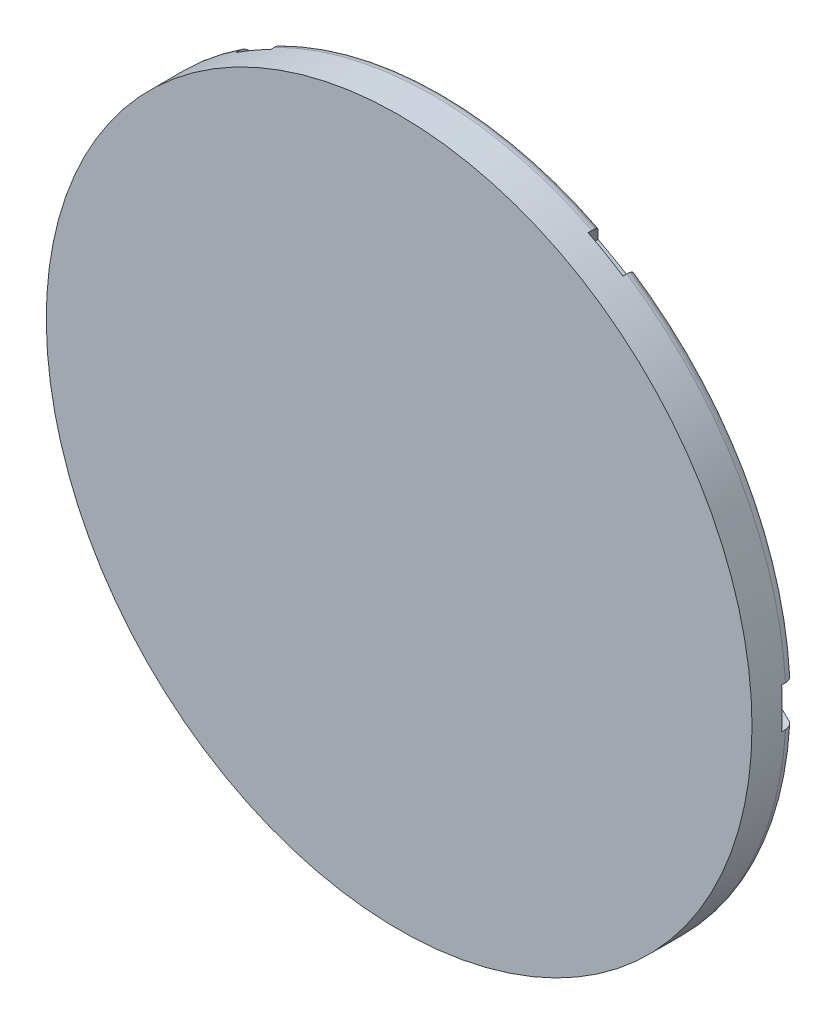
ISO-10303-21;
HEADER;
FILE_DESCRIPTION(('STEP AP214'),'2;1');
FILE_NAME('part.step','',(''),(''),'','','');
FILE_SCHEMA(('AUTOMOTIVE_DESIGN { 1 0 10303 214 1 1 1 1 }'));
ENDSEC;
DATA;
#1=APPLICATION_CONTEXT('core data for automotive mechanical design processes');
#2=APPLICATION_PROTOCOL_DEFINITION('international standard','automotive_design',2000,#1);
#3=PRODUCT_CONTEXT('',#1,'mechanical');
#4=PRODUCT('Part','Part','',(#3));
#5=PRODUCT_RELATED_PRODUCT_CATEGORY('part','',(#4));
#6=PRODUCT_DEFINITION_FORMATION('','',#4);
#7=PRODUCT_DEFINITION_CONTEXT('part definition',#1,'design');
#8=PRODUCT_DEFINITION('design','',#6,#7);
#9=PRODUCT_DEFINITION_SHAPE('','',#8);
#10=(LENGTH_UNIT() NAMED_UNIT(*) SI_UNIT(.MILLI.,.METRE.));
#11=(NAMED_UNIT(*) PLANE_ANGLE_UNIT() SI_UNIT($,.RADIAN.));
#12=(NAMED_UNIT(*) SI_UNIT($,.STERADIAN.) SOLID_ANGLE_UNIT());
#13=UNCERTAINTY_MEASURE_WITH_UNIT(LENGTH_MEASURE(1.E-05),#10,'distance_accuracy_value','');
#14=(GEOMETRIC_REPRESENTATION_CONTEXT(3) GLOBAL_UNCERTAINTY_ASSIGNED_CONTEXT((#13)) GLOBAL_UNIT_ASSIGNED_CONTEXT((#10,
#11,#12)) REPRESENTATION_CONTEXT('',''));
#15=CARTESIAN_POINT('',(0.,0.,0.));
#16=DIRECTION('',(0.,0.,1.));
#17=DIRECTION('',(1.,0.,0.));
#18=AXIS2_PLACEMENT_3D('',#15,#16,#17);
#19=CARTESIAN_POINT('',(0.,0.,1.30901699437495));
#20=DIRECTION('',(0.,0.,-1.));
#21=DIRECTION('',(-1.,0.,0.));
#22=AXIS2_PLACEMENT_3D('',#19,#20,#21);
#23=TOROIDAL_SURFACE('',#22,17.,0.5);
#24=CARTESIAN_POINT('',(-9.60172798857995,-14.6306807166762,1.30921699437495));
#25=CARTESIAN_POINT('',(-9.60174568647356,-14.6307113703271,1.28111850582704));
#26=CARTESIAN_POINT('',(-9.60055375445,-14.6286468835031,1.25302645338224));
#27=CARTESIAN_POINT('',(-9.59584007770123,-14.6204825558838,1.19766437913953));
#28=CARTESIAN_POINT('',(-9.5923207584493,-14.6143869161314,1.17039353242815));
#29=CARTESIAN_POINT('',(-9.5830397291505,-14.5983117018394,1.11741161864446));
#30=CARTESIAN_POINT('',(-9.57727719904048,-14.5883307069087,1.0917011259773));
#31=CARTESIAN_POINT('',(-9.56367623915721,-14.5647731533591,1.04257129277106));
#32=CARTESIAN_POINT('',(-9.55583730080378,-14.5511957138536,1.01915251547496));
#33=CARTESIAN_POINT('',(-9.53829660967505,-14.5208143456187,0.975245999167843));
#34=CARTESIAN_POINT('',(-9.52859238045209,-14.5040061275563,0.954762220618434));
#35=CARTESIAN_POINT('',(-9.50761433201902,-14.4676710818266,0.917367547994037));
#36=CARTESIAN_POINT('',(-9.49634285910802,-14.4481483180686,0.900451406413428));
#37=CARTESIAN_POINT('',(-9.47753356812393,-14.4155696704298,0.876867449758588));
#38=CARTESIAN_POINT('',(-9.47040524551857,-14.4032230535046,0.868872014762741));
#39=CARTESIAN_POINT('',(-9.463101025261,-14.3905717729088,0.86160339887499));
#40=B_SPLINE_CURVE_WITH_KNOTS('',3,(#24,#25,#26,#27,#28,#29,#30,#31,#32,#33,#34,#35,#36,#37,#38,
#39),.UNSPECIFIED.,.F.,.F.,(4,2,2,2,2,2,2,4),(0.,0.084182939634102,0.168278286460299,
0.252404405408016,0.336551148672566,0.420810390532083,0.504944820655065,0.553899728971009),.UNSPECIFIED.);
#41=CARTESIAN_POINT('',(-9.60172800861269,-14.6306807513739,1.30901699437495));
#42=VERTEX_POINT('',#41);
#43=CARTESIAN_POINT('',(-9.46330158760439,-14.3909191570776,0.861803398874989));
#44=VERTEX_POINT('',#43);
#45=EDGE_CURVE('E676',#42,#44,#40,.T.);
#46=ORIENTED_EDGE('',*,*,#45,.F.);
#47=CARTESIAN_POINT('',(0.,0.,1.30901699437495));
#48=DIRECTION('',(0.,0.,-1.));
#49=DIRECTION('',(-1.,0.,0.));
#50=AXIS2_PLACEMENT_3D('',#47,#48,#49);
#51=CIRCLE('',#50,17.5);
#52=CARTESIAN_POINT('',(-17.471405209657,-1.,1.30901699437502));
#53=VERTEX_POINT('',#52);
#54=EDGE_CURVE('E586',#53,#42,#51,.F.);
#55=ORIENTED_EDGE('',*,*,#54,.F.);
#56=CARTESIAN_POINT('',(-17.3894484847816,-1.,1.03492337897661));
#57=CARTESIAN_POINT('',(-17.4048448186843,-1.,1.05837669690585));
#58=CARTESIAN_POINT('',(-17.4182733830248,-1.,1.08314603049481));
#59=CARTESIAN_POINT('',(-17.4407927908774,-1.,1.13460803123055));
#60=CARTESIAN_POINT('',(-17.4498784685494,-1.,1.16130294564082));
#61=CARTESIAN_POINT('',(-17.4634335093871,-1.,1.21583046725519));
#62=CARTESIAN_POINT('',(-17.4679048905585,-1.,1.24366257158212));
#63=CARTESIAN_POINT('',(-17.4721072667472,-1.,1.29967487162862));
#64=CARTESIAN_POINT('',(-17.4718394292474,-1.,1.32785497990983));
#65=CARTESIAN_POINT('',(-17.4665756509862,-1.,1.38375815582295));
#66=CARTESIAN_POINT('',(-17.4615817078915,-1.,1.41148141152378));
#67=CARTESIAN_POINT('',(-17.4470112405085,-1.,1.46569732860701));
#68=CARTESIAN_POINT('',(-17.4374345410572,-1.,1.49218994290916));
#69=CARTESIAN_POINT('',(-17.4139697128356,-1.,1.54319893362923));
#70=CARTESIAN_POINT('',(-17.4000805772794,-1.,1.56771484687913));
#71=CARTESIAN_POINT('',(-17.3683881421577,-1.,1.61407043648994));
#72=CARTESIAN_POINT('',(-17.3505848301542,-1.,1.63591010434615));
#73=CARTESIAN_POINT('',(-17.3115478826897,-1.,1.67632133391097));
#74=CARTESIAN_POINT('',(-17.2903102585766,-1.,1.69488904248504));
#75=CARTESIAN_POINT('',(-17.2450235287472,-1.,1.72820227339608));
#76=CARTESIAN_POINT('',(-17.2209744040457,-1.,1.74294776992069));
#77=CARTESIAN_POINT('',(-17.1707057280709,-1.,1.76822325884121));
#78=CARTESIAN_POINT('',(-17.1444827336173,-1.,1.77874640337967));
#79=CARTESIAN_POINT('',(-17.09064372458,-1.,1.79524781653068));
#80=CARTESIAN_POINT('',(-17.0630276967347,-1.,1.80122604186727));
#81=CARTESIAN_POINT('',(-17.0071453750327,-1.,1.80847529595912));
#82=CARTESIAN_POINT('',(-16.9788782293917,-1.,1.80973975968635));
#83=CARTESIAN_POINT('',(-16.9225324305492,-1.,1.80750801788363));
#84=CARTESIAN_POINT('',(-16.8944537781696,-1.,1.804011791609));
#85=CARTESIAN_POINT('',(-16.8392658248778,-1.,1.79235371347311));
#86=CARTESIAN_POINT('',(-16.812157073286,-1.,1.78418926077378));
#87=CARTESIAN_POINT('',(-16.7596961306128,-1.,1.76342258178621));
#88=CARTESIAN_POINT('',(-16.734343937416,-1.,1.75082036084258));
#89=CARTESIAN_POINT('',(-16.6861321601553,-1.,1.72154186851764));
#90=CARTESIAN_POINT('',(-16.6632711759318,-1.,1.70486790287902));
#91=CARTESIAN_POINT('',(-16.6206782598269,-1.,1.66791334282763));
#92=CARTESIAN_POINT('',(-16.6009463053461,-1.,1.64763277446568));
#93=CARTESIAN_POINT('',(-16.5652034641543,-1.,1.60407239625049));
#94=CARTESIAN_POINT('',(-16.5491871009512,-1.,1.58079708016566));
#95=CARTESIAN_POINT('',(-16.5212973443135,-1.,1.53188411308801));
#96=CARTESIAN_POINT('',(-16.509423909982,-1.,1.50624648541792));
#97=CARTESIAN_POINT('',(-16.4901784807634,-1.,1.45338492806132));
#98=CARTESIAN_POINT('',(-16.4827986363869,-1.,1.42616385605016));
#99=CARTESIAN_POINT('',(-16.4727199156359,-1.,1.37086855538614));
#100=CARTESIAN_POINT('',(-16.4700210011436,-1.,1.34279433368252));
#101=CARTESIAN_POINT('',(-16.4693821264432,-1.,1.28662584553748));
#102=CARTESIAN_POINT('',(-16.4714364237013,-1.,1.25853164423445));
#103=CARTESIAN_POINT('',(-16.4802330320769,-1.,1.20308711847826));
#104=CARTESIAN_POINT('',(-16.4869753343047,-1.,1.17573679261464));
#105=CARTESIAN_POINT('',(-16.5049537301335,-1.,1.12255814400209));
#106=CARTESIAN_POINT('',(-16.5161894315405,-1.,1.09672968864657));
#107=CARTESIAN_POINT('',(-16.5428330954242,-1.,1.04732292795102));
#108=CARTESIAN_POINT('',(-16.5582410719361,-1.,1.02374463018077));
#109=CARTESIAN_POINT('',(-16.5928084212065,-1.,0.979479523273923));
#110=CARTESIAN_POINT('',(-16.6119717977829,-1.,0.958795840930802));
#111=CARTESIAN_POINT('',(-16.6534937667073,-1.,0.920932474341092));
#112=CARTESIAN_POINT('',(-16.6758523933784,-1.,0.903752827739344));
#113=CARTESIAN_POINT('',(-16.7231712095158,-1.,0.873353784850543));
#114=CARTESIAN_POINT('',(-16.7481358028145,-1.,0.860141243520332));
#115=CARTESIAN_POINT('',(-16.7999263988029,-1.,0.838087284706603));
#116=CARTESIAN_POINT('',(-16.8267524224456,-1.,0.829245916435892));
#117=CARTESIAN_POINT('',(-16.8815501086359,-1.,0.816171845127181));
#118=CARTESIAN_POINT('',(-16.9095235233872,-1.,0.811946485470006));
#119=CARTESIAN_POINT('',(-16.965781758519,-1.,0.808248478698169));
#120=CARTESIAN_POINT('',(-16.9940665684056,-1.,0.808775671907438));
#121=CARTESIAN_POINT('',(-17.0501643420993,-1.,0.814569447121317));
#122=CARTESIAN_POINT('',(-17.0779770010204,-1.,0.819838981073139));
#123=CARTESIAN_POINT('',(-17.1323297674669,-1.,0.834976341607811));
#124=CARTESIAN_POINT('',(-17.1588695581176,-1.,0.844845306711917));
#125=CARTESIAN_POINT('',(-17.2099133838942,-1.,0.868902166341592));
#126=CARTESIAN_POINT('',(-17.2344172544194,-1.,0.883090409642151));
#127=CARTESIAN_POINT('',(-17.2806679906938,-1.,0.915375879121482));
#128=CARTESIAN_POINT('',(-17.3024181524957,-1.,0.933468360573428));
#129=CARTESIAN_POINT('',(-17.3350439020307,-1.,0.965629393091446));
#130=CARTESIAN_POINT('',(-17.3469456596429,-1.,0.978674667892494));
#131=CARTESIAN_POINT('',(-17.3693071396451,-1.,1.00594762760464));
#132=CARTESIAN_POINT('',(-17.3797668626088,-1.,1.02017531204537));
#133=CARTESIAN_POINT('',(-17.3894484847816,-1.,1.03492337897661));
#134=B_SPLINE_CURVE_WITH_KNOTS('',3,(#56,#57,#58,#59,#60,#61,#62,#63,#64,#65,#66,#67,#68,#69,
#70,#71,#72,#73,#74,#75,#76,#77,#78,#79,#80,#81,#82,#83,#84,#85,#86,#87,#88,#89,#90,#91,#92,#93,
#94,#95,#96,#97,#98,#99,#100,#101,#102,#103,#104,#105,#106,#107,#108,#109,#110,#111,#112,#113,
#114,#115,#116,#117,#118,#119,#120,#121,#122,#123,#124,#125,#126,#127,#128,#129,#130,#131,#132,
#133),.UNSPECIFIED.,.T.,.F.,(4,2,2,2,2,2,2,2,2,2,2,2,2,2,2,2,2,2,2,2,2,2,2,2,2,2,2,2,2,2,2,2,2,
2,2,2,2,2,4),(0.,0.0841018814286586,0.168303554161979,0.252468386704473,0.336612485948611,
0.420721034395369,0.504832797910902,0.588964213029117,0.673095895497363,0.757326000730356,
0.841556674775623,0.925923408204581,1.0102909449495,1.09477593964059,1.17926130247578,
1.26379378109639,1.3483261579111,1.4328107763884,1.51729478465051,1.6016534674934,
1.68601131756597,1.7702213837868,1.85443076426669,1.93853846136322,2.02264599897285,
2.10674619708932,2.190846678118,2.27503731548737,2.35922885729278,2.44356505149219,
2.52790219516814,2.61237331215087,2.69684159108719,2.78136248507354,2.86590431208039,
2.95045296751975,3.03489944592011,3.08778495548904,3.14067044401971),.UNSPECIFIED.);
#135=CARTESIAN_POINT('',(-17.1945523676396,-1.,0.86180339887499));
#136=VERTEX_POINT('',#135);
#137=EDGE_CURVE('E597',#136,#53,#134,.T.);
#138=ORIENTED_EDGE('',*,*,#137,.F.);
#139=CARTESIAN_POINT('',(0.,0.,0.86180339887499));
#140=DIRECTION('',(0.,0.,1.));
#141=DIRECTION('',(1.,0.,0.));
#142=AXIS2_PLACEMENT_3D('',#139,#140,#141);
#143=CIRCLE('',#142,17.22360679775);
#144=EDGE_CURVE('E572',#44,#136,#143,.F.);
#145=ORIENTED_EDGE('',*,*,#144,.F.);
#146=EDGE_LOOP('',(#46,#55,#138,#145));
#147=FACE_BOUND('',#146,.T.);
#148=ADVANCED_FACE('F35',(#147),#23,.T.);
#149=CARTESIAN_POINT('',(-7.61397447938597,-15.1877906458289,0.809128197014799));
#150=CARTESIAN_POINT('',(-7.62811155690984,-15.2122767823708,0.808502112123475));
#151=CARTESIAN_POINT('',(-7.64228391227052,-15.2368240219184,0.810325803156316));
#152=CARTESIAN_POINT('',(-7.67019022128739,-15.2851591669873,0.818671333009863));
#153=CARTESIAN_POINT('',(-7.68392632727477,-15.3089508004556,0.825164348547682));
#154=CARTESIAN_POINT('',(-7.70306634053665,-15.3421022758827,0.837690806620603));
#155=CARTESIAN_POINT('',(-7.708780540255,-15.3519995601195,0.841899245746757));
#156=CARTESIAN_POINT('',(-7.72004556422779,-15.3715111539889,0.851138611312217));
#157=CARTESIAN_POINT('',(-7.72559624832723,-15.3811252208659,0.856170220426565));
#158=CARTESIAN_POINT('',(-7.74362926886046,-15.4123593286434,0.874134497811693));
#159=CARTESIAN_POINT('',(-7.75569384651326,-15.4332557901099,0.888801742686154));
#160=CARTESIAN_POINT('',(-7.77843204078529,-15.4726394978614,0.921990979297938));
#161=CARTESIAN_POINT('',(-7.78910358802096,-15.4911231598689,0.940518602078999));
#162=CARTESIAN_POINT('',(-7.80873277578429,-15.5251219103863,0.980884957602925));
#163=CARTESIAN_POINT('',(-7.81769164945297,-15.5406391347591,1.00272128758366));
#164=CARTESIAN_POINT('',(-7.83364705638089,-15.5682747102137,1.04909785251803));
#165=CARTESIAN_POINT('',(-7.8406433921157,-15.5803927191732,1.0736383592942));
#166=CARTESIAN_POINT('',(-7.85247081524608,-15.6008784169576,1.12471344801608));
#167=CARTESIAN_POINT('',(-7.8573024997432,-15.6092471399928,1.15124747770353));
#168=CARTESIAN_POINT('',(-7.86465728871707,-15.6219860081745,1.20552357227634));
#169=CARTESIAN_POINT('',(-7.86718480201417,-15.6263637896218,1.23326322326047));
#170=CARTESIAN_POINT('',(-7.86929795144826,-15.6300238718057,1.27716604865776));
#171=CARTESIAN_POINT('',(-7.86968039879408,-15.6306862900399,1.29319168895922));
#172=CARTESIAN_POINT('',(-7.86967398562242,-15.6306751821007,1.32513077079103));
#173=CARTESIAN_POINT('',(-7.86929047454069,-15.6300109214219,1.34104421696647));
#174=CARTESIAN_POINT('',(-7.86852668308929,-15.6286879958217,1.35689181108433));
#175=B_SPLINE_CURVE_WITH_KNOTS('',3,(#149,#150,#151,#152,#153,#154,#155,#156,#157,#158,#159,
#160,#161,#162,#163,#164,#165,#166,#167,#168,#169,#170,#171,#172,#173,#174),.UNSPECIFIED.,.F.,
.F.,(4,2,2,2,2,2,2,2,2,2,2,2,4),(0.,0.0847819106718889,0.169044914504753,0.205553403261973,
0.242092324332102,0.326365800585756,0.410763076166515,0.495099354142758,0.579444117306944,
0.663765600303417,0.747925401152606,0.79599022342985,0.843720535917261),.UNSPECIFIED.);
#176=CARTESIAN_POINT('',(-7.73125078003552,-15.3909191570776,0.86180339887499));
#177=VERTEX_POINT('',#176);
#178=CARTESIAN_POINT('',(-7.86967720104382,-15.6306807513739,1.30901699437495));
#179=VERTEX_POINT('',#178);
#180=EDGE_CURVE('E257',#177,#179,#175,.T.);
#181=ORIENTED_EDGE('',*,*,#180,.F.);
#182=CARTESIAN_POINT('',(7.7312507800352,-15.3909191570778,0.861803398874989));
#183=VERTEX_POINT('',#182);
#184=EDGE_CURVE('E662',#183,#177,#143,.F.);
#185=ORIENTED_EDGE('',*,*,#184,.F.);
#186=CARTESIAN_POINT('',(7.86967718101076,-15.6306807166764,1.30921699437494));
#187=CARTESIAN_POINT('',(7.86969487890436,-15.6307113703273,1.28111850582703));
#188=CARTESIAN_POINT('',(7.8685029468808,-15.6286468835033,1.25302645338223));
#189=CARTESIAN_POINT('',(7.86378927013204,-15.620482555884,1.19766437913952));
#190=CARTESIAN_POINT('',(7.86026995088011,-15.6143869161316,1.17039353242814));
#191=CARTESIAN_POINT('',(7.85098892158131,-15.5983117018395,1.11741161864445));
#192=CARTESIAN_POINT('',(7.84522639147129,-15.5883307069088,1.0917011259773));
#193=CARTESIAN_POINT('',(7.83162543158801,-15.5647731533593,1.04257129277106));
#194=CARTESIAN_POINT('',(7.82378649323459,-15.5511957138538,1.01915251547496));
#195=CARTESIAN_POINT('',(7.80624580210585,-15.5208143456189,0.975245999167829));
#196=CARTESIAN_POINT('',(7.79654157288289,-15.5040061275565,0.954762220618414));
#197=CARTESIAN_POINT('',(7.77556352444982,-15.4676710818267,0.917367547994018));
#198=CARTESIAN_POINT('',(7.76429205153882,-15.4481483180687,0.900451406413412));
#199=CARTESIAN_POINT('',(7.7454827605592,-15.4155696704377,0.876867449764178));
#200=CARTESIAN_POINT('',(7.73835443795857,-15.4032230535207,0.868872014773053));
#201=CARTESIAN_POINT('',(7.73105021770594,-15.3905717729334,0.861603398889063));
#202=B_SPLINE_CURVE_WITH_KNOTS('',3,(#186,#187,#188,#189,#190,#191,#192,#193,#194,#195,#196,
#197,#198,#199,#200,#201),.UNSPECIFIED.,.F.,.F.,(4,2,2,2,2,2,2,4),(0.,0.0841829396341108,
0.168278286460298,0.252404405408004,0.336551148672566,0.420810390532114,0.504944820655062,
0.55389972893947),.UNSPECIFIED.);
#203=CARTESIAN_POINT('',(7.86967720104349,-15.6306807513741,1.30901699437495));
#204=VERTEX_POINT('',#203);
#205=EDGE_CURVE('E443',#204,#183,#202,.T.);
#206=ORIENTED_EDGE('',*,*,#205,.F.);
#207=EDGE_CURVE('E589',#179,#204,#51,.F.);
#208=ORIENTED_EDGE('',*,*,#207,.F.);
#209=EDGE_LOOP('',(#181,#185,#206,#208));
#210=FACE_BOUND('',#209,.T.);
#211=ADVANCED_FACE('F622',(#210),#23,.T.);
#212=CARTESIAN_POINT('',(9.4631010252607,-14.390571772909,0.86160339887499));
#213=CARTESIAN_POINT('',(9.47571061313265,-14.4124122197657,0.874136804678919));
#214=CARTESIAN_POINT('',(9.48777786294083,-14.4333133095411,0.888833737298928));
#215=CARTESIAN_POINT('',(9.51050445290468,-14.4726769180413,0.922039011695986));
#216=CARTESIAN_POINT('',(9.52116509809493,-14.4911416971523,0.940543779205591));
#217=CARTESIAN_POINT('',(9.54078409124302,-14.5251227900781,0.980882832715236));
#218=CARTESIAN_POINT('',(9.54974172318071,-14.5406378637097,1.00271851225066));
#219=CARTESIAN_POINT('',(9.56569671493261,-14.5682727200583,1.0490951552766));
#220=CARTESIAN_POINT('',(9.5726936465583,-14.5803917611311,1.07363670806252));
#221=CARTESIAN_POINT('',(9.58452065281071,-14.6008767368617,1.12470852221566));
#222=CARTESIAN_POINT('',(9.58935188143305,-14.6092446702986,1.1512377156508));
#223=CARTESIAN_POINT('',(9.59670658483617,-14.6219833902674,1.20551166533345));
#224=CARTESIAN_POINT('',(9.59923355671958,-14.6263602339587,1.23325451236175));
#225=CARTESIAN_POINT('',(9.60134977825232,-14.6300256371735,1.27716784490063));
#226=CARTESIAN_POINT('',(9.60173424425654,-14.6306915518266,1.29319705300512));
#227=CARTESIAN_POINT('',(9.60172798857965,-14.6306807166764,1.30921699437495));
#228=B_SPLINE_CURVE_WITH_KNOTS('',3,(#212,#213,#214,#215,#216,#217,#218,#219,#220,#221,#222,
#223,#224,#225,#226,#227),.UNSPECIFIED.,.F.,.F.,(4,2,2,2,2,2,2,4),(0.,0.0843747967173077,
0.168670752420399,0.253002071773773,0.337351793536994,0.421656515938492,0.505833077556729,
0.553897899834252),.UNSPECIFIED.);
#229=CARTESIAN_POINT('',(9.46330158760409,-14.3909191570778,0.861803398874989));
#230=VERTEX_POINT('',#229);
#231=CARTESIAN_POINT('',(9.60172800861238,-14.6306807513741,1.30901699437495));
#232=VERTEX_POINT('',#231);
#233=EDGE_CURVE('E696',#230,#232,#228,.T.);
#234=ORIENTED_EDGE('',*,*,#233,.F.);
#235=CARTESIAN_POINT('',(17.1945523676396,-1.00000000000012,0.861803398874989));
#236=VERTEX_POINT('',#235);
#237=EDGE_CURVE('E657',#236,#230,#143,.F.);
#238=ORIENTED_EDGE('',*,*,#237,.F.);
#239=CARTESIAN_POINT('',(16.5315054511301,-1.00000000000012,1.06836502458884));
#240=CARTESIAN_POINT('',(16.5179888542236,-1.00000000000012,1.09293919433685));
#241=CARTESIAN_POINT('',(16.5065360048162,-1.00000000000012,1.11867160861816));
#242=CARTESIAN_POINT('',(16.4881034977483,-1.00000000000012,1.17171524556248));
#243=CARTESIAN_POINT('',(16.4811291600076,-1.00000000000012,1.19902830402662));
#244=CARTESIAN_POINT('',(16.4718699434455,-1.00000000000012,1.2544283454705));
#245=CARTESIAN_POINT('',(16.4695829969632,-1.00000000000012,1.28251498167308));
#246=CARTESIAN_POINT('',(16.4697601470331,-1.00000000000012,1.33866570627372));
#247=CARTESIAN_POINT('',(16.4722230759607,-1.00000000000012,1.36672979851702));
#248=CARTESIAN_POINT('',(16.4818247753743,-1.00000000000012,1.42203702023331));
#249=CARTESIAN_POINT('',(16.4889620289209,-1.00000000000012,1.44928041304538));
#250=CARTESIAN_POINT('',(16.5077067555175,-1.00000000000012,1.50218429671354));
#251=CARTESIAN_POINT('',(16.5193144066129,-1.00000000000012,1.52784472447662));
#252=CARTESIAN_POINT('',(16.5466755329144,-1.00000000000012,1.5768695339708));
#253=CARTESIAN_POINT('',(16.5624313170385,-1.00000000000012,1.60023262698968));
#254=CARTESIAN_POINT('',(16.5976360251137,-1.00000000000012,1.64398712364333));
#255=CARTESIAN_POINT('',(16.6170849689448,-1.00000000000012,1.66437851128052));
#256=CARTESIAN_POINT('',(16.6591549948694,-1.00000000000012,1.70164434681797));
#257=CARTESIAN_POINT('',(16.6817808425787,-1.00000000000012,1.71851341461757));
#258=CARTESIAN_POINT('',(16.7295393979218,-1.00000000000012,1.74822134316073));
#259=CARTESIAN_POINT('',(16.7546721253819,-1.00000000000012,1.76106017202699));
#260=CARTESIAN_POINT('',(16.8067780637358,-1.00000000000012,1.78236621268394));
#261=CARTESIAN_POINT('',(16.8337544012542,-1.00000000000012,1.79082577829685));
#262=CARTESIAN_POINT('',(16.8887436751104,-1.00000000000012,1.8031019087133));
#263=CARTESIAN_POINT('',(16.9167566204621,-1.00000000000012,1.8069184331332));
#264=CARTESIAN_POINT('',(16.9730591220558,-1.00000000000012,1.80980291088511));
#265=CARTESIAN_POINT('',(17.0013489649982,-1.00000000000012,1.80886527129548));
#266=CARTESIAN_POINT('',(17.0573699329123,-1.00000000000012,1.80225455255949));
#267=CARTESIAN_POINT('',(17.0851010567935,-1.00000000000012,1.79658146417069));
#268=CARTESIAN_POINT('',(17.1392202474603,-1.00000000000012,1.78065810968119));
#269=CARTESIAN_POINT('',(17.1656081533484,-1.00000000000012,1.7704072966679));
#270=CARTESIAN_POINT('',(17.2162861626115,-1.00000000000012,1.74561694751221));
#271=CARTESIAN_POINT('',(17.2405762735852,-1.00000000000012,1.73107742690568));
#272=CARTESIAN_POINT('',(17.2863437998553,-1.00000000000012,1.69813596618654));
#273=CARTESIAN_POINT('',(17.3078238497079,-1.00000000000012,1.67973768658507));
#274=CARTESIAN_POINT('',(17.3473842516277,-1.00000000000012,1.63959096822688));
#275=CARTESIAN_POINT('',(17.3654646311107,-1.00000000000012,1.61784255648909));
#276=CARTESIAN_POINT('',(17.3976821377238,-1.00000000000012,1.57164926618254));
#277=CARTESIAN_POINT('',(17.411825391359,-1.00000000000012,1.54720866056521));
#278=CARTESIAN_POINT('',(17.4358007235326,-1.00000000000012,1.49629720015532));
#279=CARTESIAN_POINT('',(17.4456328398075,-1.00000000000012,1.46982636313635));
#280=CARTESIAN_POINT('',(17.4606920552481,-1.00000000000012,1.41564892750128));
#281=CARTESIAN_POINT('',(17.4659260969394,-1.00000000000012,1.38794425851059));
#282=CARTESIAN_POINT('',(17.4716643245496,-1.00000000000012,1.33204940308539));
#283=CARTESIAN_POINT('',(17.4721685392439,-1.00000000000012,1.30385921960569));
#284=CARTESIAN_POINT('',(17.4684342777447,-1.00000000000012,1.24781866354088));
#285=CARTESIAN_POINT('',(17.4641997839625,-1.00000000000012,1.21996802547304));
#286=CARTESIAN_POINT('',(17.4511158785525,-1.00000000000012,1.16537281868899));
#287=CARTESIAN_POINT('',(17.4422664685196,-1.00000000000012,1.13862824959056));
#288=CARTESIAN_POINT('',(17.4202040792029,-1.00000000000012,1.08699878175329));
#289=CARTESIAN_POINT('',(17.4069903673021,-1.00000000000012,1.06211419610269));
#290=CARTESIAN_POINT('',(17.3765771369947,-1.00000000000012,1.01491339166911));
#291=CARTESIAN_POINT('',(17.3593776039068,-1.00000000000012,0.992597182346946));
#292=CARTESIAN_POINT('',(17.3214614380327,-1.00000000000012,0.951139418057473));
#293=CARTESIAN_POINT('',(17.300740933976,-1.00000000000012,0.932001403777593));
#294=CARTESIAN_POINT('',(17.256385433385,-1.00000000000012,0.897468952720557));
#295=CARTESIAN_POINT('',(17.2327504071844,-1.00000000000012,0.882074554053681));
#296=CARTESIAN_POINT('',(17.1831963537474,-1.00000000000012,0.855440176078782));
#297=CARTESIAN_POINT('',(17.1572737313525,-1.00000000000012,0.844206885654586));
#298=CARTESIAN_POINT('',(17.1039121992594,-1.00000000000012,0.826244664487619));
#299=CARTESIAN_POINT('',(17.0764732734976,-1.00000000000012,0.819515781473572));
#300=CARTESIAN_POINT('',(17.0208153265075,-1.00000000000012,0.810744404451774));
#301=CARTESIAN_POINT('',(16.9925952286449,-1.00000000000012,0.808708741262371));
#302=CARTESIAN_POINT('',(16.9362144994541,-1.00000000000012,0.809400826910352));
#303=CARTESIAN_POINT('',(16.908053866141,-1.00000000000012,0.812128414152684));
#304=CARTESIAN_POINT('',(16.8525745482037,-1.00000000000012,0.822272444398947));
#305=CARTESIAN_POINT('',(16.825256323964,-1.00000000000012,0.829691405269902));
#306=CARTESIAN_POINT('',(16.7722467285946,-1.00000000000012,0.84901497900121));
#307=CARTESIAN_POINT('',(16.7465557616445,-1.00000000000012,0.860920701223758));
#308=CARTESIAN_POINT('',(16.6975420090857,-1.00000000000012,0.88887893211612));
#309=CARTESIAN_POINT('',(16.6742192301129,-1.00000000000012,0.904931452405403));
#310=CARTESIAN_POINT('',(16.630626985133,-1.00000000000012,0.940719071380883));
#311=CARTESIAN_POINT('',(16.6103538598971,-1.00000000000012,0.960449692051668));
#312=CARTESIAN_POINT('',(16.5803364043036,-1.00000000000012,0.99505185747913));
#313=CARTESIAN_POINT('',(16.5694890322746,-1.00000000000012,1.00898298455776));
#314=CARTESIAN_POINT('',(16.5493241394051,-1.00000000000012,1.0379116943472));
#315=CARTESIAN_POINT('',(16.5400066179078,-1.00000000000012,1.05290927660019));
#316=CARTESIAN_POINT('',(16.5315054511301,-1.00000000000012,1.06836502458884));
#317=B_SPLINE_CURVE_WITH_KNOTS('',3,(#239,#240,#241,#242,#243,#244,#245,#246,#247,#248,#249,
#250,#251,#252,#253,#254,#255,#256,#257,#258,#259,#260,#261,#262,#263,#264,#265,#266,#267,#268,
#269,#270,#271,#272,#273,#274,#275,#276,#277,#278,#279,#280,#281,#282,#283,#284,#285,#286,#287,
#288,#289,#290,#291,#292,#293,#294,#295,#296,#297,#298,#299,#300,#301,#302,#303,#304,#305,#306,
#307,#308,#309,#310,#311,#312,#313,#314,#315,#316),.UNSPECIFIED.,.T.,.F.,(4,2,2,2,2,2,2,2,2,2,2,
2,2,2,2,2,2,2,2,2,2,2,2,2,2,2,2,2,2,2,2,2,2,2,2,2,2,2,4),(0.,0.0840742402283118,
0.168248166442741,0.252384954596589,0.336501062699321,0.420589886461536,0.504682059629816,
0.588821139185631,0.672960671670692,0.757227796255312,0.8414955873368,0.925910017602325,
1.01032518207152,1.09483967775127,1.17935433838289,1.26387909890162,1.3484035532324,
1.43284818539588,1.51729213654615,1.60160394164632,1.68591500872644,1.77009855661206,
1.85428159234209,1.93839393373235,2.02250624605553,2.10663268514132,2.19075943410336,
2.27497928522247,2.35919999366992,2.44355550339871,2.52791190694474,2.61239101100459,
2.69686724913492,2.78138886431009,2.8659313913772,2.95047415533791,3.03491465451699,
3.08779256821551,3.14067045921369),.UNSPECIFIED.);
#318=CARTESIAN_POINT('',(17.4714052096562,-1.00000000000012,1.30901699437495));
#319=VERTEX_POINT('',#318);
#320=EDGE_CURVE('E710',#319,#236,#317,.T.);
#321=ORIENTED_EDGE('',*,*,#320,.F.);
#322=EDGE_CURVE('E706',#232,#319,#51,.F.);
#323=ORIENTED_EDGE('',*,*,#322,.F.);
#324=EDGE_LOOP('',(#234,#238,#321,#323));
#325=FACE_BOUND('',#324,.T.);
#326=ADVANCED_FACE('F627',(#325),#23,.T.);
#327=CARTESIAN_POINT('',(16.5315054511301,0.999999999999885,1.06836502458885));
#328=CARTESIAN_POINT('',(16.5450539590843,0.999999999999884,1.04373802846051));
#329=CARTESIAN_POINT('',(16.5606950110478,0.999999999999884,1.02023862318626));
#330=CARTESIAN_POINT('',(16.5957156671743,0.999999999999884,0.976181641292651));
#331=CARTESIAN_POINT('',(16.6150998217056,0.999999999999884,0.955627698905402));
#332=CARTESIAN_POINT('',(16.6570339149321,0.999999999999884,0.918074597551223));
#333=CARTESIAN_POINT('',(16.6795820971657,0.999999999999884,0.901073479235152));
#334=CARTESIAN_POINT('',(16.7272034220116,0.999999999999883,0.871097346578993));
#335=CARTESIAN_POINT('',(16.7522759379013,0.999999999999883,0.858121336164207));
#336=CARTESIAN_POINT('',(16.8042761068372,0.999999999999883,0.836537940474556));
#337=CARTESIAN_POINT('',(16.8312062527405,0.999999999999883,0.827936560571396));
#338=CARTESIAN_POINT('',(16.8861285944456,0.999999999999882,0.815370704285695));
#339=CARTESIAN_POINT('',(16.9141208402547,0.999999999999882,0.811406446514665));
#340=CARTESIAN_POINT('',(16.9704068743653,0.999999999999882,0.808224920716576));
#341=CARTESIAN_POINT('',(16.9987009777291,0.999999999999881,0.809013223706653));
#342=CARTESIAN_POINT('',(17.054755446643,0.999999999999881,0.815328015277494));
#343=CARTESIAN_POINT('',(17.0825158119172,0.999999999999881,0.820854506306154));
#344=CARTESIAN_POINT('',(17.1367182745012,0.99999999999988,0.836491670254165));
#345=CARTESIAN_POINT('',(17.1631601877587,0.99999999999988,0.846602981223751));
#346=CARTESIAN_POINT('',(17.2139688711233,0.99999999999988,0.871125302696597));
#347=CARTESIAN_POINT('',(17.2383356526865,0.99999999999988,0.885536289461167));
#348=CARTESIAN_POINT('',(17.28427736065,0.999999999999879,0.918235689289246));
#349=CARTESIAN_POINT('',(17.3058548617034,0.999999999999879,0.936520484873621));
#350=CARTESIAN_POINT('',(17.3456279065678,0.999999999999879,0.976458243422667));
#351=CARTESIAN_POINT('',(17.3638234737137,0.999999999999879,0.998111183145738));
#352=CARTESIAN_POINT('',(17.3962856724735,0.999999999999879,1.0441345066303));
#353=CARTESIAN_POINT('',(17.4105583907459,0.999999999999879,1.06850059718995));
#354=CARTESIAN_POINT('',(17.4348033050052,0.999999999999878,1.11928585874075));
#355=CARTESIAN_POINT('',(17.4447755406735,0.999999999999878,1.14570501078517));
#356=CARTESIAN_POINT('',(17.4601213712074,0.999999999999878,1.19980329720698));
#357=CARTESIAN_POINT('',(17.4655019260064,0.999999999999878,1.22748045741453));
#358=CARTESIAN_POINT('',(17.4715356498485,0.999999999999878,1.28334531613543));
#359=CARTESIAN_POINT('',(17.4721888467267,0.999999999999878,1.31153301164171));
#360=CARTESIAN_POINT('',(17.4687506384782,0.999999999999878,1.36759324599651));
#361=CARTESIAN_POINT('',(17.4646632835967,0.999999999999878,1.3954660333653));
#362=CARTESIAN_POINT('',(17.4518677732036,0.999999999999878,1.45012988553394));
#363=CARTESIAN_POINT('',(17.4431596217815,0.999999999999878,1.47692095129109));
#364=CARTESIAN_POINT('',(17.4213700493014,0.999999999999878,1.52866597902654));
#365=CARTESIAN_POINT('',(17.4082879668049,0.999999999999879,1.5536196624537));
#366=CARTESIAN_POINT('',(17.3781244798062,0.999999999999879,1.60097974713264));
#367=CARTESIAN_POINT('',(17.3610430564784,0.999999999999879,1.62338613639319));
#368=CARTESIAN_POINT('',(17.3233466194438,0.999999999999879,1.66504258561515));
#369=CARTESIAN_POINT('',(17.3027277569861,0.999999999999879,1.68428916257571));
#370=CARTESIAN_POINT('',(17.2585559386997,0.99999999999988,1.71905418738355));
#371=CARTESIAN_POINT('',(17.2350029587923,0.99999999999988,1.73457260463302));
#372=CARTESIAN_POINT('',(17.185591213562,0.99999999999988,1.76146720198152));
#373=CARTESIAN_POINT('',(17.1597288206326,0.99999999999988,1.77283671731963));
#374=CARTESIAN_POINT('',(17.1064641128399,0.999999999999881,1.7910795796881));
#375=CARTESIAN_POINT('',(17.0790617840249,0.999999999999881,1.79795288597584));
#376=CARTESIAN_POINT('',(17.0234526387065,0.999999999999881,1.80701743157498));
#377=CARTESIAN_POINT('',(16.9952447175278,0.999999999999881,1.80920189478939));
#378=CARTESIAN_POINT('',(16.9388621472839,0.999999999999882,1.80880754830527));
#379=CARTESIAN_POINT('',(16.9106874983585,0.999999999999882,1.80622871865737));
#380=CARTESIAN_POINT('',(16.8551519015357,0.999999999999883,1.79637708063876));
#381=CARTESIAN_POINT('',(16.8277915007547,0.999999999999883,1.78910118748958));
#382=CARTESIAN_POINT('',(16.7746812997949,0.999999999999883,1.77005722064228));
#383=CARTESIAN_POINT('',(16.7489315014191,0.999999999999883,1.75828914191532));
#384=CARTESIAN_POINT('',(16.6997871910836,0.999999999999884,1.73059892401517));
#385=CARTESIAN_POINT('',(16.6763916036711,0.999999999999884,1.71467869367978));
#386=CARTESIAN_POINT('',(16.6326100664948,0.999999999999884,1.67913119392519));
#387=CARTESIAN_POINT('',(16.6122241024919,0.999999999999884,1.65950394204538));
#388=CARTESIAN_POINT('',(16.5750717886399,0.999999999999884,1.61712835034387));
#389=CARTESIAN_POINT('',(16.5583004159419,0.999999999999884,1.59438441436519));
#390=CARTESIAN_POINT('',(16.5288227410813,0.999999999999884,1.54640047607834));
#391=CARTESIAN_POINT('',(16.5161162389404,0.999999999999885,1.52116059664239));
#392=CARTESIAN_POINT('',(16.4951523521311,0.999999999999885,1.46895123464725));
#393=CARTESIAN_POINT('',(16.4868867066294,0.999999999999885,1.44198506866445));
#394=CARTESIAN_POINT('',(16.4750048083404,0.999999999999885,1.387039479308));
#395=CARTESIAN_POINT('',(16.4713896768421,0.999999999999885,1.35905981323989));
#396=CARTESIAN_POINT('',(16.4689162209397,0.999999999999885,1.3029166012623));
#397=CARTESIAN_POINT('',(16.4700540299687,0.999999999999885,1.27475322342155));
#398=CARTESIAN_POINT('',(16.4770460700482,0.999999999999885,1.2190419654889));
#399=CARTESIAN_POINT('',(16.4828945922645,0.999999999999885,1.19149338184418));
#400=CARTESIAN_POINT('',(16.4960489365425,0.999999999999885,1.1479482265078));
#401=CARTESIAN_POINT('',(16.5019691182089,0.999999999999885,1.13151985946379));
#402=CARTESIAN_POINT('',(16.5154926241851,0.999999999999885,1.0993711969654));
#403=CARTESIAN_POINT('',(16.5230959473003,0.999999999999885,1.08365090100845));
#404=CARTESIAN_POINT('',(16.5315054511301,0.999999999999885,1.06836502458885));
#405=B_SPLINE_CURVE_WITH_KNOTS('',3,(#327,#328,#329,#330,#331,#332,#333,#334,#335,#336,#337,
#338,#339,#340,#341,#342,#343,#344,#345,#346,#347,#348,#349,#350,#351,#352,#353,#354,#355,#356,
#357,#358,#359,#360,#361,#362,#363,#364,#365,#366,#367,#368,#369,#370,#371,#372,#373,#374,#375,
#376,#377,#378,#379,#380,#381,#382,#383,#384,#385,#386,#387,#388,#389,#390,#391,#392,#393,#394,
#395,#396,#397,#398,#399,#400,#401,#402,#403,#404),.UNSPECIFIED.,.T.,.F.,(4,2,2,2,2,2,2,2,2,2,2,
2,2,2,2,2,2,2,2,2,2,2,2,2,2,2,2,2,2,2,2,2,2,2,2,2,2,2,4),(0.,0.0842597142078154,
0.168622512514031,0.252938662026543,0.337233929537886,0.421644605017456,0.50605925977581,
0.590572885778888,0.675086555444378,0.759611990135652,0.844136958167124,0.928583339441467,
1.01302913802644,1.0973431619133,1.18165640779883,1.26584162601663,1.35002634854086,
1.43413919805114,1.51825197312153,1.60237747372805,1.68650337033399,1.77072138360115,
1.85494008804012,1.9392934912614,2.02364765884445,2.10812364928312,2.19259999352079,
2.27713187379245,2.36166384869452,2.44615703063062,2.5306498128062,2.61502441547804,
2.69939486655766,2.78360782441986,2.86784108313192,2.95200583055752,3.03606873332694,
3.0883684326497,3.14066809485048),.UNSPECIFIED.);
#406=CARTESIAN_POINT('',(17.1945523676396,0.99999999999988,0.861803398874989));
#407=VERTEX_POINT('',#406);
#408=CARTESIAN_POINT('',(17.4714052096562,0.999999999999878,1.30901699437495));
#409=VERTEX_POINT('',#408);
#410=EDGE_CURVE('E467',#407,#409,#405,.T.);
#411=ORIENTED_EDGE('',*,*,#410,.F.);
#412=CARTESIAN_POINT('',(9.46330158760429,14.3909191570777,0.86180339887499));
#413=VERTEX_POINT('',#412);
#414=EDGE_CURVE('E655',#413,#407,#143,.F.);
#415=ORIENTED_EDGE('',*,*,#414,.F.);
#416=CARTESIAN_POINT('',(9.60172798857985,14.6306807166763,1.30921699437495));
#417=CARTESIAN_POINT('',(9.60174568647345,14.6307113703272,1.28111850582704));
#418=CARTESIAN_POINT('',(9.60055375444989,14.6286468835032,1.25302645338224));
#419=CARTESIAN_POINT('',(9.59584007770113,14.6204825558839,1.19766437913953));
#420=CARTESIAN_POINT('',(9.5923207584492,14.6143869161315,1.17039353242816));
#421=CARTESIAN_POINT('',(9.5830397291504,14.5983117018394,1.11741161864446));
#422=CARTESIAN_POINT('',(9.57727719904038,14.5883307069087,1.0917011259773));
#423=CARTESIAN_POINT('',(9.5636762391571,14.5647731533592,1.04257129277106));
#424=CARTESIAN_POINT('',(9.55583730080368,14.5511957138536,1.01915251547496));
#425=CARTESIAN_POINT('',(9.53829660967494,14.5208143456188,0.975245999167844));
#426=CARTESIAN_POINT('',(9.52859238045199,14.5040061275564,0.954762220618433));
#427=CARTESIAN_POINT('',(9.50761433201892,14.4676710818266,0.917367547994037));
#428=CARTESIAN_POINT('',(9.49634285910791,14.4481483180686,0.90045140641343));
#429=CARTESIAN_POINT('',(9.47753356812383,14.4155696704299,0.876867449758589));
#430=CARTESIAN_POINT('',(9.47040524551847,14.4032230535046,0.868872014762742));
#431=CARTESIAN_POINT('',(9.4631010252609,14.3905717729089,0.861603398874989));
#432=B_SPLINE_CURVE_WITH_KNOTS('',3,(#416,#417,#418,#419,#420,#421,#422,#423,#424,#425,#426,
#427,#428,#429,#430,#431),.UNSPECIFIED.,.F.,.F.,(4,2,2,2,2,2,2,4),(0.,0.0841829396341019,
0.168278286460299,0.252404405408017,0.336551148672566,0.420810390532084,0.504944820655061,
0.553899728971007),.UNSPECIFIED.);
#433=CARTESIAN_POINT('',(9.60172800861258,14.630680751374,1.30901699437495));
#434=VERTEX_POINT('',#433);
#435=EDGE_CURVE('E500',#434,#413,#432,.T.);
#436=ORIENTED_EDGE('',*,*,#435,.F.);
#437=EDGE_CURVE('E711',#409,#434,#51,.F.);
#438=ORIENTED_EDGE('',*,*,#437,.F.);
#439=EDGE_LOOP('',(#411,#415,#436,#438));
#440=FACE_BOUND('',#439,.T.);
#441=ADVANCED_FACE('F638',(#440),#23,.T.);
#442=CARTESIAN_POINT('',(7.61397447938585,15.1877906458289,0.809128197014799));
#443=CARTESIAN_POINT('',(7.62811155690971,15.2122767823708,0.808502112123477));
#444=CARTESIAN_POINT('',(7.64228391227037,15.2368240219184,0.810325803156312));
#445=CARTESIAN_POINT('',(7.67019022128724,15.2851591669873,0.818671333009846));
#446=CARTESIAN_POINT('',(7.68392632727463,15.3089508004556,0.825164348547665));
#447=CARTESIAN_POINT('',(7.70306634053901,15.3421022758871,0.837690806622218));
#448=CARTESIAN_POINT('',(7.70878054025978,15.351999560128,0.841899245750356));
#449=CARTESIAN_POINT('',(7.72004556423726,15.3715111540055,0.851138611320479));
#450=CARTESIAN_POINT('',(7.72559624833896,15.3811252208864,0.856170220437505));
#451=CARTESIAN_POINT('',(7.74362926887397,15.412359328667,0.874134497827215));
#452=CARTESIAN_POINT('',(7.75569384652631,15.4332557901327,0.888801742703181));
#453=CARTESIAN_POINT('',(7.77843204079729,15.4726394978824,0.921990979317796));
#454=CARTESIAN_POINT('',(7.78910358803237,15.491123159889,0.940518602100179));
#455=CARTESIAN_POINT('',(7.80873277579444,15.5251219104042,0.980884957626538));
#456=CARTESIAN_POINT('',(7.81769164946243,15.5406391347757,1.00272128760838));
#457=CARTESIAN_POINT('',(7.8336470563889,15.5682747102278,1.04909785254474));
#458=CARTESIAN_POINT('',(7.84064339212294,15.580392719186,1.07363835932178));
#459=CARTESIAN_POINT('',(7.85247081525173,15.6008784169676,1.12471344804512));
#460=CARTESIAN_POINT('',(7.85730249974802,15.6092471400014,1.15124747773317));
#461=CARTESIAN_POINT('',(7.86465728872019,15.6219860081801,1.20552357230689));
#462=CARTESIAN_POINT('',(7.86718480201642,15.626363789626,1.23326322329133));
#463=CARTESIAN_POINT('',(7.86929795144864,15.6300238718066,1.27716604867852));
#464=CARTESIAN_POINT('',(7.86968039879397,15.6306862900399,1.29319168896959));
#465=CARTESIAN_POINT('',(7.86967398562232,15.6306751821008,1.32513077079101));
#466=CARTESIAN_POINT('',(7.86929047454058,15.6300109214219,1.34104421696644));
#467=CARTESIAN_POINT('',(7.86852668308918,15.6286879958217,1.35689181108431));
#468=B_SPLINE_CURVE_WITH_KNOTS('',3,(#442,#443,#444,#445,#446,#447,#448,#449,#450,#451,#452,
#453,#454,#455,#456,#457,#458,#459,#460,#461,#462,#463,#464,#465,#466,#467),.UNSPECIFIED.,.F.,
.F.,(4,2,2,2,2,2,2,2,2,2,2,2,4),(0.,0.084781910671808,0.169044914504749,0.205553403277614,
0.242092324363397,0.326365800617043,0.410763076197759,0.495099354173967,0.579444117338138,
0.663765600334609,0.74792540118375,0.795990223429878,0.843720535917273),.UNSPECIFIED.);
#469=CARTESIAN_POINT('',(7.73125078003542,15.3909191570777,0.86180339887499));
#470=VERTEX_POINT('',#469);
#471=CARTESIAN_POINT('',(7.86967720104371,15.630680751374,1.30901699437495));
#472=VERTEX_POINT('',#471);
#473=EDGE_CURVE('E647',#470,#472,#468,.T.);
#474=ORIENTED_EDGE('',*,*,#473,.F.);
#475=CARTESIAN_POINT('',(-7.73125078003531,15.3909191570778,0.861803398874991));
#476=VERTEX_POINT('',#475);
#477=EDGE_CURVE('E594',#476,#470,#143,.F.);
#478=ORIENTED_EDGE('',*,*,#477,.F.);
#479=CARTESIAN_POINT('',(-7.86967718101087,15.6306807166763,1.30921699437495));
#480=CARTESIAN_POINT('',(-7.86969487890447,15.6307113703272,1.28111850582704));
#481=CARTESIAN_POINT('',(-7.86850294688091,15.6286468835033,1.25302645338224));
#482=CARTESIAN_POINT('',(-7.86378927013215,15.6204825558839,1.19766437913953));
#483=CARTESIAN_POINT('',(-7.86026995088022,15.6143869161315,1.17039353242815));
#484=CARTESIAN_POINT('',(-7.85098892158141,15.5983117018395,1.11741161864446));
#485=CARTESIAN_POINT('',(-7.8452263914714,15.5883307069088,1.0917011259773));
#486=CARTESIAN_POINT('',(-7.83162543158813,15.5647731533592,1.04257129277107));
#487=CARTESIAN_POINT('',(-7.8237864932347,15.5511957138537,1.01915251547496));
#488=CARTESIAN_POINT('',(-7.80624580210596,15.5208143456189,0.975245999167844));
#489=CARTESIAN_POINT('',(-7.79654157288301,15.5040061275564,0.954762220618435));
#490=CARTESIAN_POINT('',(-7.77556352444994,15.4676710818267,0.917367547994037));
#491=CARTESIAN_POINT('',(-7.76429205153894,15.4481483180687,0.900451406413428));
#492=CARTESIAN_POINT('',(-7.74548276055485,15.4155696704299,0.876867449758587));
#493=CARTESIAN_POINT('',(-7.73835443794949,15.4032230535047,0.868872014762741));
#494=CARTESIAN_POINT('',(-7.73105021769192,15.3905717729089,0.86160339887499));
#495=B_SPLINE_CURVE_WITH_KNOTS('',3,(#479,#480,#481,#482,#483,#484,#485,#486,#487,#488,#489,
#490,#491,#492,#493,#494),.UNSPECIFIED.,.F.,.F.,(4,2,2,2,2,2,2,4),(0.,0.0841829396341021,
0.168278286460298,0.252404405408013,0.336551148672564,0.420810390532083,0.504944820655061,
0.553899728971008),.UNSPECIFIED.);
#496=CARTESIAN_POINT('',(-7.8696772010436,15.630680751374,1.30901699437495));
#497=VERTEX_POINT('',#496);
#498=EDGE_CURVE('E718',#497,#476,#495,.T.);
#499=ORIENTED_EDGE('',*,*,#498,.F.);
#500=EDGE_CURVE('E584',#472,#497,#51,.F.);
#501=ORIENTED_EDGE('',*,*,#500,.F.);
#502=EDGE_LOOP('',(#474,#478,#499,#501));
#503=FACE_BOUND('',#502,.T.);
#504=ADVANCED_FACE('F620',(#503),#23,.T.);
#505=CARTESIAN_POINT('',(0.,0.,2.));
#506=DIRECTION('',(0.,0.,-1.));
#507=DIRECTION('',(-1.,0.,0.));
#508=AXIS2_PLACEMENT_3D('',#505,#506,#507);
#509=CYLINDRICAL_SURFACE('',#508,17.5);
#510=ORIENTED_EDGE('',*,*,#54,.T.);
#511=DIRECTION('',(0.,0.,-1.));
#512=VECTOR('',#511,1.);
#513=CARTESIAN_POINT('',(-9.60172800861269,-14.6306807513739,2.));
#514=LINE('',#513,#512);
#515=CARTESIAN_POINT('',(-9.60172800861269,-14.6306807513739,1.5));
#516=VERTEX_POINT('',#515);
#517=EDGE_CURVE('E677',#42,#516,#514,.F.);
#518=ORIENTED_EDGE('',*,*,#517,.T.);
#519=CARTESIAN_POINT('',(0.,0.,1.5));
#520=DIRECTION('',(0.,0.,-1.));
#521=DIRECTION('',(-1.,0.,0.));
#522=AXIS2_PLACEMENT_3D('',#519,#520,#521);
#523=CIRCLE('',#522,17.5);
#524=CARTESIAN_POINT('',(-7.86967720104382,-15.6306807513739,1.5));
#525=VERTEX_POINT('',#524);
#526=EDGE_CURVE('E12',#525,#516,#523,.T.);
#527=ORIENTED_EDGE('',*,*,#526,.F.);
#528=DIRECTION('',(0.,0.,-1.));
#529=VECTOR('',#528,1.);
#530=CARTESIAN_POINT('',(-7.86967720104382,-15.6306807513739,2.));
#531=LINE('',#530,#529);
#532=EDGE_CURVE('E244',#525,#179,#531,.T.);
#533=ORIENTED_EDGE('',*,*,#532,.T.);
#534=ORIENTED_EDGE('',*,*,#207,.T.);
#535=DIRECTION('',(0.,0.,-1.));
#536=VECTOR('',#535,1.);
#537=CARTESIAN_POINT('',(7.86967720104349,-15.6306807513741,2.));
#538=LINE('',#537,#536);
#539=CARTESIAN_POINT('',(7.86967720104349,-15.6306807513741,1.5));
#540=VERTEX_POINT('',#539);
#541=EDGE_CURVE('E450',#204,#540,#538,.F.);
#542=ORIENTED_EDGE('',*,*,#541,.T.);
#543=CARTESIAN_POINT('',(0.,0.,1.5));
#544=DIRECTION('',(0.,0.,-1.));
#545=DIRECTION('',(-1.,0.,0.));
#546=AXIS2_PLACEMENT_3D('',#543,#544,#545);
#547=CIRCLE('',#546,17.5);
#548=CARTESIAN_POINT('',(9.60172800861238,-14.6306807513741,1.5));
#549=VERTEX_POINT('',#548);
#550=EDGE_CURVE('E287',#549,#540,#547,.T.);
#551=ORIENTED_EDGE('',*,*,#550,.F.);
#552=DIRECTION('',(0.,0.,-1.));
#553=VECTOR('',#552,1.);
#554=CARTESIAN_POINT('',(9.60172800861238,-14.6306807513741,2.));
#555=LINE('',#554,#553);
#556=EDGE_CURVE('E451',#549,#232,#555,.T.);
#557=ORIENTED_EDGE('',*,*,#556,.T.);
#558=ORIENTED_EDGE('',*,*,#322,.T.);
#559=DIRECTION('',(0.,0.,-1.));
#560=VECTOR('',#559,1.);
#561=CARTESIAN_POINT('',(17.4714052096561,-1.00000000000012,2.));
#562=LINE('',#561,#560);
#563=CARTESIAN_POINT('',(17.4714052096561,-1.00000000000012,1.5));
#564=VERTEX_POINT('',#563);
#565=EDGE_CURVE('E799',#319,#564,#562,.F.);
#566=ORIENTED_EDGE('',*,*,#565,.T.);
#567=CARTESIAN_POINT('',(0.,0.,1.5));
#568=DIRECTION('',(0.,0.,-1.));
#569=DIRECTION('',(-1.,0.,0.));
#570=AXIS2_PLACEMENT_3D('',#567,#568,#569);
#571=CIRCLE('',#570,17.5);
#572=CARTESIAN_POINT('',(17.4714052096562,0.999999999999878,1.5));
#573=VERTEX_POINT('',#572);
#574=EDGE_CURVE('E758',#573,#564,#571,.T.);
#575=ORIENTED_EDGE('',*,*,#574,.F.);
#576=DIRECTION('',(0.,0.,-1.));
#577=VECTOR('',#576,1.);
#578=CARTESIAN_POINT('',(17.4714052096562,0.999999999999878,2.));
#579=LINE('',#578,#577);
#580=EDGE_CURVE('E473',#573,#409,#579,.T.);
#581=ORIENTED_EDGE('',*,*,#580,.T.);
#582=ORIENTED_EDGE('',*,*,#437,.T.);
#583=DIRECTION('',(0.,0.,-1.));
#584=VECTOR('',#583,1.);
#585=CARTESIAN_POINT('',(9.60172800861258,14.630680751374,2.));
#586=LINE('',#585,#584);
#587=CARTESIAN_POINT('',(9.60172800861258,14.630680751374,1.5));
#588=VERTEX_POINT('',#587);
#589=EDGE_CURVE('E507',#434,#588,#586,.F.);
#590=ORIENTED_EDGE('',*,*,#589,.T.);
#591=CARTESIAN_POINT('',(0.,0.,1.5));
#592=DIRECTION('',(0.,0.,-1.));
#593=DIRECTION('',(-1.,0.,0.));
#594=AXIS2_PLACEMENT_3D('',#591,#592,#593);
#595=CIRCLE('',#594,17.5);
#596=CARTESIAN_POINT('',(7.86967720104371,15.630680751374,1.5));
#597=VERTEX_POINT('',#596);
#598=EDGE_CURVE('E751',#597,#588,#595,.T.);
#599=ORIENTED_EDGE('',*,*,#598,.F.);
#600=DIRECTION('',(0.,0.,-1.));
#601=VECTOR('',#600,1.);
#602=CARTESIAN_POINT('',(7.86967720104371,15.630680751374,2.));
#603=LINE('',#602,#601);
#604=EDGE_CURVE('E508',#597,#472,#603,.T.);
#605=ORIENTED_EDGE('',*,*,#604,.T.);
#606=ORIENTED_EDGE('',*,*,#500,.T.);
#607=DIRECTION('',(0.,0.,-1.));
#608=VECTOR('',#607,1.);
#609=CARTESIAN_POINT('',(-7.8696772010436,15.630680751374,2.));
#610=LINE('',#609,#608);
#611=CARTESIAN_POINT('',(-7.8696772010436,15.630680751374,1.5));
#612=VERTEX_POINT('',#611);
#613=EDGE_CURVE('E544',#497,#612,#610,.F.);
#614=ORIENTED_EDGE('',*,*,#613,.T.);
#615=CARTESIAN_POINT('',(0.,0.,1.5));
#616=DIRECTION('',(0.,0.,-1.));
#617=DIRECTION('',(-1.,0.,0.));
#618=AXIS2_PLACEMENT_3D('',#615,#616,#617);
#619=CIRCLE('',#618,17.5);
#620=CARTESIAN_POINT('',(-9.60172800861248,14.630680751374,1.5));
#621=VERTEX_POINT('',#620);
#622=EDGE_CURVE('E720',#621,#612,#619,.T.);
#623=ORIENTED_EDGE('',*,*,#622,.F.);
#624=DIRECTION('',(0.,0.,-1.));
#625=VECTOR('',#624,1.);
#626=CARTESIAN_POINT('',(-9.60172800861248,14.630680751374,2.));
#627=LINE('',#626,#625);
#628=CARTESIAN_POINT('',(-9.60172800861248,14.630680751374,1.30901699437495));
#629=VERTEX_POINT('',#628);
#630=EDGE_CURVE('E539',#621,#629,#627,.T.);
#631=ORIENTED_EDGE('',*,*,#630,.T.);
#632=CARTESIAN_POINT('',(-17.4714052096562,1.,1.30901699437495));
#633=VERTEX_POINT('',#632);
#634=EDGE_CURVE('E582',#629,#633,#51,.F.);
#635=ORIENTED_EDGE('',*,*,#634,.T.);
#636=DIRECTION('',(0.,0.,-1.));
#637=VECTOR('',#636,1.);
#638=CARTESIAN_POINT('',(-17.4714052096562,1.,2.));
#639=LINE('',#638,#637);
#640=CARTESIAN_POINT('',(-17.4714052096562,1.,1.5));
#641=VERTEX_POINT('',#640);
#642=EDGE_CURVE('E578',#633,#641,#639,.F.);
#643=ORIENTED_EDGE('',*,*,#642,.T.);
#644=CARTESIAN_POINT('',(0.,0.,1.5));
#645=DIRECTION('',(0.,0.,-1.));
#646=DIRECTION('',(-1.,0.,0.));
#647=AXIS2_PLACEMENT_3D('',#644,#645,#646);
#648=CIRCLE('',#647,17.5);
#649=CARTESIAN_POINT('',(-17.4714052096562,-1.,1.5));
#650=VERTEX_POINT('',#649);
#651=EDGE_CURVE('E721',#650,#641,#648,.T.);
#652=ORIENTED_EDGE('',*,*,#651,.F.);
#653=DIRECTION('',(0.,0.,-1.));
#654=VECTOR('',#653,1.);
#655=CARTESIAN_POINT('',(-17.4714052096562,-1.,2.));
#656=LINE('',#655,#654);
#657=EDGE_CURVE('E573',#650,#53,#656,.T.);
#658=ORIENTED_EDGE('',*,*,#657,.T.);
#659=EDGE_LOOP('',(#510,#518,#527,#533,#534,#542,#551,#557,#558,#566,#575,#581,#582,#590,#599,
#605,#606,#614,#623,#631,#635,#643,#652,#658));
#660=FACE_BOUND('',#659,.T.);
#661=CARTESIAN_POINT('',(0.,0.,3.));
#662=DIRECTION('',(0.,0.,1.));
#663=DIRECTION('',(1.,0.,0.));
#664=AXIS2_PLACEMENT_3D('',#661,#662,#663);
#665=CIRCLE('',#664,17.5);
#666=CARTESIAN_POINT('',(17.5,0.,3.));
#667=VERTEX_POINT('',#666);
#668=EDGE_CURVE('E251',#667,#667,#665,.T.);
#669=ORIENTED_EDGE('',*,*,#668,.F.);
#670=EDGE_LOOP('',(#669));
#671=FACE_BOUND('',#670,.T.);
#672=ADVANCED_FACE('F299',(#660,#671),#509,.T.);
#673=CARTESIAN_POINT('',(0.,0.,0.));
#674=DIRECTION('',(0.,0.,1.));
#675=DIRECTION('',(1.,0.,0.));
#676=AXIS2_PLACEMENT_3D('',#673,#674,#675);
#677=PLANE('',#676);
#678=CARTESIAN_POINT('',(0.,0.,0.));
#679=DIRECTION('',(0.,0.,1.));
#680=DIRECTION('',(1.,0.,0.));
#681=AXIS2_PLACEMENT_3D('',#678,#679,#680);
#682=CIRCLE('',#681,15.3819660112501);
#683=CARTESIAN_POINT('',(15.3819660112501,0.,0.));
#684=VERTEX_POINT('',#683);
#685=EDGE_CURVE('E593',#684,#684,#682,.F.);
#686=ORIENTED_EDGE('',*,*,#685,.T.);
#687=EDGE_LOOP('',(#686));
#688=FACE_BOUND('',#687,.T.);
#689=ADVANCED_FACE('F297',(#688),#677,.F.);
#690=CARTESIAN_POINT('',(0.,0.,1.));
#691=DIRECTION('',(0.,0.,1.));
#692=DIRECTION('',(1.,0.,0.));
#693=AXIS2_PLACEMENT_3D('',#690,#691,#692);
#694=CONICAL_SURFACE('',#693,17.5,1.10714871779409);
#695=CARTESIAN_POINT('',(-9.46350192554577,-14.3912661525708,0.86200339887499));
#696=CARTESIAN_POINT('',(-9.36390585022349,-14.2187606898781,0.762574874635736));
#697=CARTESIAN_POINT('',(-9.26430847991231,-14.0462529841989,0.663151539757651));
#698=CARTESIAN_POINT('',(-9.06511114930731,-13.701233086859,0.464315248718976));
#699=CARTESIAN_POINT('',(-8.96551118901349,-13.5287208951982,0.364902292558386));
#700=CARTESIAN_POINT('',(-8.86590993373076,-13.3562064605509,0.265494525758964));
#701=B_SPLINE_CURVE_WITH_KNOTS('',3,(#695,#696,#697,#698,#699,#700),.UNSPECIFIED.,.F.,.F.,(4,2,
4),(0.,0.667886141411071,1.33577228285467),.UNSPECIFIED.);
#702=CARTESIAN_POINT('',(-8.8660254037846,-13.3564064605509,0.265609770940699));
#703=VERTEX_POINT('',#702);
#704=EDGE_CURVE('E43',#44,#703,#701,.T.);
#705=ORIENTED_EDGE('',*,*,#704,.F.);
#706=ORIENTED_EDGE('',*,*,#144,.T.);
#707=CARTESIAN_POINT('',(-14.4761653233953,-1.,-0.494668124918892));
#708=CARTESIAN_POINT('',(-15.3223375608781,-1.,-0.0725491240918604));
#709=CARTESIAN_POINT('',(-16.1684654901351,-1.,0.349658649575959));
#710=CARTESIAN_POINT('',(-17.8606327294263,-1.,1.19425174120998));
#711=CARTESIAN_POINT('',(-18.7066720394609,-1.,1.6166370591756));
#712=CARTESIAN_POINT('',(-19.5526670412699,-1.,2.03911114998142));
#713=B_SPLINE_CURVE_WITH_KNOTS('',3,(#707,#708,#709,#710,#711,#712),.UNSPECIFIED.,.F.,.F.,(4,2,
4),(0.,2.83685158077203,5.6737031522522),.UNSPECIFIED.);
#714=CARTESIAN_POINT('',(-16.,-1.,0.265609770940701));
#715=VERTEX_POINT('',#714);
#716=EDGE_CURVE('E304',#715,#136,#713,.T.);
#717=ORIENTED_EDGE('',*,*,#716,.F.);
#718=CARTESIAN_POINT('',(-16.,3.58741573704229,0.448621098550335));
#719=CARTESIAN_POINT('',(-16.,3.22674745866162,0.409134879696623));
#720=CARTESIAN_POINT('',(-16.,2.86544476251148,0.375307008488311));
#721=CARTESIAN_POINT('',(-16.,2.14190988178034,0.319395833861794));
#722=CARTESIAN_POINT('',(-16.,1.77967763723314,0.297313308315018));
#723=CARTESIAN_POINT('',(-16.,1.05624994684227,0.265395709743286));
#724=CARTESIAN_POINT('',(-16.,0.695056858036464,0.255507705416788));
#725=CARTESIAN_POINT('',(-16.,-0.0274428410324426,0.2479740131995));
#726=CARTESIAN_POINT('',(-16.,-0.388749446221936,0.250327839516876));
#727=CARTESIAN_POINT('',(-16.,-1.11100500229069,0.267234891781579));
#728=CARTESIAN_POINT('',(-16.,-1.47195400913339,0.281785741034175));
#729=CARTESIAN_POINT('',(-16.,-2.193188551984,0.322819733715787));
#730=CARTESIAN_POINT('',(-16.,-2.55347405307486,0.34930348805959));
#731=CARTESIAN_POINT('',(-16.,-3.27458809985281,0.413893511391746));
#732=CARTESIAN_POINT('',(-16.,-3.63541208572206,0.452050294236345));
#733=CARTESIAN_POINT('',(-16.,-4.3556939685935,0.539294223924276));
#734=CARTESIAN_POINT('',(-16.,-4.71515202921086,0.588380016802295));
#735=CARTESIAN_POINT('',(-16.,-5.07381155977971,0.642609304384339));
#736=B_SPLINE_CURVE_WITH_KNOTS('',3,(#718,#719,#720,#721,#722,#723,#724,#725,#726,#727,#728,
#729,#730,#731,#732,#733,#734,#735),.UNSPECIFIED.,.F.,.F.,(4,2,2,2,2,2,2,2,4),(0.,
1.08844767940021,2.17696743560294,3.26074556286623,4.34448068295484,5.42800467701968,
6.51158414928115,7.59992066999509,8.6881224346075),.UNSPECIFIED.);
#737=CARTESIAN_POINT('',(-16.,1.,0.265609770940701));
#738=VERTEX_POINT('',#737);
#739=EDGE_CURVE('E324',#738,#715,#736,.T.);
#740=ORIENTED_EDGE('',*,*,#739,.F.);
#741=CARTESIAN_POINT('',(-19.5526670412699,1.,2.03911114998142));
#742=CARTESIAN_POINT('',(-18.7066720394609,1.,1.6166370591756));
#743=CARTESIAN_POINT('',(-17.8606327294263,1.,1.19425174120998));
#744=CARTESIAN_POINT('',(-16.1684654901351,1.,0.349658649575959));
#745=CARTESIAN_POINT('',(-15.3223375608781,1.,-0.0725491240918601));
#746=CARTESIAN_POINT('',(-14.4761653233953,1.,-0.494668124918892));
#747=B_SPLINE_CURVE_WITH_KNOTS('',3,(#741,#742,#743,#744,#745,#746),.UNSPECIFIED.,.F.,.F.,(4,2,
4),(0.,2.83685157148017,5.6737031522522),.UNSPECIFIED.);
#748=CARTESIAN_POINT('',(-17.1945523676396,1.,0.86180339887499));
#749=VERTEX_POINT('',#748);
#750=EDGE_CURVE('E315',#749,#738,#747,.T.);
#751=ORIENTED_EDGE('',*,*,#750,.F.);
#752=CARTESIAN_POINT('',(-9.46330158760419,14.3909191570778,0.86180339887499));
#753=VERTEX_POINT('',#752);
#754=EDGE_CURVE('E538',#749,#753,#143,.F.);
#755=ORIENTED_EDGE('',*,*,#754,.T.);
#756=CARTESIAN_POINT('',(-8.86590993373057,13.356206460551,0.265494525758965));
#757=CARTESIAN_POINT('',(-8.9655111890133,13.5287208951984,0.364902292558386));
#758=CARTESIAN_POINT('',(-9.06511114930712,13.7012330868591,0.464315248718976));
#759=CARTESIAN_POINT('',(-9.26430847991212,14.0462529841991,0.663151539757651));
#760=CARTESIAN_POINT('',(-9.36390585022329,14.2187606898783,0.762574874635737));
#761=CARTESIAN_POINT('',(-9.46350192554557,14.3912661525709,0.86200339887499));
#762=B_SPLINE_CURVE_WITH_KNOTS('',3,(#756,#757,#758,#759,#760,#761),.UNSPECIFIED.,.F.,.F.,(4,2,
4),(0.,0.667886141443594,1.33577228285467),.UNSPECIFIED.);
#763=CARTESIAN_POINT('',(-8.86602540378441,13.356406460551,0.2656097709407));
#764=VERTEX_POINT('',#763);
#765=EDGE_CURVE('E334',#764,#753,#762,.T.);
#766=ORIENTED_EDGE('',*,*,#765,.F.);
#767=CARTESIAN_POINT('',(-7.13377459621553,14.3565219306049,0.265616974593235));
#768=CARTESIAN_POINT('',(-7.42251639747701,14.1898167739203,0.255205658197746));
#769=CARTESIAN_POINT('',(-7.71125819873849,14.0231116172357,0.250000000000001));
#770=CARTESIAN_POINT('',(-8.28874180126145,13.6897013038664,0.250000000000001));
#771=CARTESIAN_POINT('',(-8.57748360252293,13.5229961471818,0.255205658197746));
#772=CARTESIAN_POINT('',(-8.86622540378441,13.3562909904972,0.265616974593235));
#773=B_SPLINE_CURVE_WITH_KNOTS('',3,(#767,#768,#769,#770,#771,#772),.UNSPECIFIED.,.F.,.F.,(4,2,
4),(0.,1.00035284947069,2.00070569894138),.UNSPECIFIED.);
#774=CARTESIAN_POINT('',(-7.13397459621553,14.356406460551,0.265609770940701));
#775=VERTEX_POINT('',#774);
#776=EDGE_CURVE('E353',#775,#764,#773,.T.);
#777=ORIENTED_EDGE('',*,*,#776,.F.);
#778=CARTESIAN_POINT('',(-7.73145111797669,15.3912661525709,0.862003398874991));
#779=CARTESIAN_POINT('',(-7.63185504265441,15.2187606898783,0.762574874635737));
#780=CARTESIAN_POINT('',(-7.53225767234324,15.0462529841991,0.663151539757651));
#781=CARTESIAN_POINT('',(-7.33306034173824,14.7012330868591,0.464315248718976));
#782=CARTESIAN_POINT('',(-7.23346038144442,14.5287208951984,0.364902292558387));
#783=CARTESIAN_POINT('',(-7.13385912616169,14.356206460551,0.265494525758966));
#784=B_SPLINE_CURVE_WITH_KNOTS('',3,(#778,#779,#780,#781,#782,#783),.UNSPECIFIED.,.F.,.F.,(4,2,
4),(0.,0.667886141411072,1.33577228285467),.UNSPECIFIED.);
#785=EDGE_CURVE('E344',#476,#775,#784,.T.);
#786=ORIENTED_EDGE('',*,*,#785,.F.);
#787=ORIENTED_EDGE('',*,*,#477,.T.);
#788=CARTESIAN_POINT('',(7.13385912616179,14.356206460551,0.265494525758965));
#789=CARTESIAN_POINT('',(7.23346038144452,14.5287208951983,0.364902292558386));
#790=CARTESIAN_POINT('',(7.33306034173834,14.701233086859,0.464315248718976));
#791=CARTESIAN_POINT('',(7.53225767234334,15.046252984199,0.663151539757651));
#792=CARTESIAN_POINT('',(7.63185504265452,15.2187606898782,0.762574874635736));
#793=CARTESIAN_POINT('',(7.7314511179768,15.3912661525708,0.86200339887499));
#794=B_SPLINE_CURVE_WITH_KNOTS('',3,(#788,#789,#790,#791,#792,#793),.UNSPECIFIED.,.F.,.F.,(4,2,
4),(0.,0.667886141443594,1.33577228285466),.UNSPECIFIED.);
#795=CARTESIAN_POINT('',(7.13397459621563,14.356406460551,0.2656097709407));
#796=VERTEX_POINT('',#795);
#797=EDGE_CURVE('E363',#796,#470,#794,.T.);
#798=ORIENTED_EDGE('',*,*,#797,.F.);
#799=CARTESIAN_POINT('',(8.8662254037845,13.3562909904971,0.265616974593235));
#800=CARTESIAN_POINT('',(8.57748360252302,13.5229961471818,0.255205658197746));
#801=CARTESIAN_POINT('',(8.28874180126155,13.6897013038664,0.250000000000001));
#802=CARTESIAN_POINT('',(7.71125819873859,14.0231116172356,0.250000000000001));
#803=CARTESIAN_POINT('',(7.42251639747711,14.1898167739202,0.255205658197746));
#804=CARTESIAN_POINT('',(7.13377459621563,14.3565219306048,0.265616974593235));
#805=B_SPLINE_CURVE_WITH_KNOTS('',3,(#799,#800,#801,#802,#803,#804),.UNSPECIFIED.,.F.,.F.,(4,2,
4),(0.,1.00035284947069,2.00070569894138),.UNSPECIFIED.);
#806=CARTESIAN_POINT('',(8.8660254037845,13.356406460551,0.2656097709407));
#807=VERTEX_POINT('',#806);
#808=EDGE_CURVE('E371',#807,#796,#805,.T.);
#809=ORIENTED_EDGE('',*,*,#808,.F.);
#810=CARTESIAN_POINT('',(9.46350192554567,14.3912661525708,0.86200339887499));
#811=CARTESIAN_POINT('',(9.36390585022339,14.2187606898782,0.762574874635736));
#812=CARTESIAN_POINT('',(9.26430847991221,14.046252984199,0.663151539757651));
#813=CARTESIAN_POINT('',(9.06511114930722,13.701233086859,0.464315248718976));
#814=CARTESIAN_POINT('',(8.96551118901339,13.5287208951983,0.364902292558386));
#815=CARTESIAN_POINT('',(8.86590993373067,13.356206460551,0.265494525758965));
#816=B_SPLINE_CURVE_WITH_KNOTS('',3,(#810,#811,#812,#813,#814,#815),.UNSPECIFIED.,.F.,.F.,(4,2,
4),(0.,0.667886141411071,1.33577228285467),.UNSPECIFIED.);
#817=EDGE_CURVE('E379',#413,#807,#816,.T.);
#818=ORIENTED_EDGE('',*,*,#817,.F.);
#819=ORIENTED_EDGE('',*,*,#414,.T.);
#820=CARTESIAN_POINT('',(13.579720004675,0.999999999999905,-0.941755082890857));
#821=CARTESIAN_POINT('',(14.0028403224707,0.999999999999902,-0.730764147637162));
#822=CARTESIAN_POINT('',(14.4259409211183,0.999999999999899,-0.51973367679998));
#823=CARTESIAN_POINT('',(15.272109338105,0.999999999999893,-0.0976070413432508));
#824=CARTESIAN_POINT('',(15.6951771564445,0.999999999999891,0.113489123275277));
#825=CARTESIAN_POINT('',(16.964341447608,0.999999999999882,0.746856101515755));
#826=CARTESIAN_POINT('',(17.810398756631,0.999999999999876,1.16920539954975));
#827=CARTESIAN_POINT('',(18.6564305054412,0.99999999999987,1.59160584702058));
#828=B_SPLINE_CURVE_WITH_KNOTS('',3,(#820,#821,#822,#823,#824,#825,#826,#827),.UNSPECIFIED.,.F.,
.F.,(4,2,2,4),(0.,1.41842580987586,2.83685159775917,5.67370317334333),.UNSPECIFIED.);
#829=CARTESIAN_POINT('',(16.,0.999999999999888,0.265609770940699));
#830=VERTEX_POINT('',#829);
#831=EDGE_CURVE('E388',#830,#407,#828,.T.);
#832=ORIENTED_EDGE('',*,*,#831,.F.);
#833=CARTESIAN_POINT('',(16.,-5.07381155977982,0.642609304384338));
#834=CARTESIAN_POINT('',(16.,-4.71515202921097,0.588380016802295));
#835=CARTESIAN_POINT('',(16.,-4.35569396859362,0.539294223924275));
#836=CARTESIAN_POINT('',(16.,-3.63541208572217,0.452050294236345));
#837=CARTESIAN_POINT('',(16.,-3.27458809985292,0.413893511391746));
#838=CARTESIAN_POINT('',(16.,-2.55347405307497,0.34930348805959));
#839=CARTESIAN_POINT('',(16.,-2.19318855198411,0.322819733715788));
#840=CARTESIAN_POINT('',(16.,-1.4719540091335,0.281785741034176));
#841=CARTESIAN_POINT('',(16.,-1.1110050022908,0.267234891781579));
#842=CARTESIAN_POINT('',(16.,-0.388749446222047,0.250327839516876));
#843=CARTESIAN_POINT('',(16.,-0.0274428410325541,0.2479740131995));
#844=CARTESIAN_POINT('',(16.,0.695056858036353,0.255507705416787));
#845=CARTESIAN_POINT('',(16.,1.05624994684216,0.265395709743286));
#846=CARTESIAN_POINT('',(16.,1.77967763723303,0.297313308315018));
#847=CARTESIAN_POINT('',(16.,2.14190988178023,0.319395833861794));
#848=CARTESIAN_POINT('',(16.,2.86544476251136,0.375307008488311));
#849=CARTESIAN_POINT('',(16.,3.2267474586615,0.409134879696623));
#850=CARTESIAN_POINT('',(16.,3.58741573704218,0.448621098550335));
#851=B_SPLINE_CURVE_WITH_KNOTS('',3,(#833,#834,#835,#836,#837,#838,#839,#840,#841,#842,#843,
#844,#845,#846,#847,#848,#849,#850),.UNSPECIFIED.,.F.,.F.,(4,2,2,2,2,2,2,2,4),(0.,
1.08820176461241,2.17653828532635,3.26011775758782,4.34364175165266,5.42737687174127,
6.51115499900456,7.59967475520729,8.6881224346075),.UNSPECIFIED.);
#852=CARTESIAN_POINT('',(16.,-1.00000000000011,0.2656097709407));
#853=VERTEX_POINT('',#852);
#854=EDGE_CURVE('E396',#853,#830,#851,.T.);
#855=ORIENTED_EDGE('',*,*,#854,.F.);
#856=CARTESIAN_POINT('',(18.6564305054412,-1.00000000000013,1.59160584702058));
#857=CARTESIAN_POINT('',(17.810398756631,-1.00000000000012,1.16920539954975));
#858=CARTESIAN_POINT('',(16.964341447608,-1.00000000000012,0.74685610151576));
#859=CARTESIAN_POINT('',(15.6951771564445,-1.00000000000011,0.113489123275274));
#860=CARTESIAN_POINT('',(15.272109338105,-1.00000000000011,-0.0976070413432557));
#861=CARTESIAN_POINT('',(14.4259409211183,-1.0000000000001,-0.519733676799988));
#862=CARTESIAN_POINT('',(14.0028403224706,-1.0000000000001,-0.730764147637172));
#863=CARTESIAN_POINT('',(13.579720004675,-1.00000000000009,-0.941755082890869));
#864=B_SPLINE_CURVE_WITH_KNOTS('',3,(#856,#857,#858,#859,#860,#861,#862,#863),.UNSPECIFIED.,.F.,
.F.,(4,2,2,4),(0.,2.83685157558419,4.25527736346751,5.67370317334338),.UNSPECIFIED.);
#865=EDGE_CURVE('E404',#236,#853,#864,.T.);
#866=ORIENTED_EDGE('',*,*,#865,.F.);
#867=ORIENTED_EDGE('',*,*,#237,.T.);
#868=CARTESIAN_POINT('',(8.86590993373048,-13.3562064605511,0.265494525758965));
#869=CARTESIAN_POINT('',(8.9655111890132,-13.5287208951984,0.364902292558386));
#870=CARTESIAN_POINT('',(9.06511114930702,-13.7012330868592,0.464315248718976));
#871=CARTESIAN_POINT('',(9.26430847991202,-14.0462529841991,0.663151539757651));
#872=CARTESIAN_POINT('',(9.36390585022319,-14.2187606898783,0.762574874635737));
#873=CARTESIAN_POINT('',(9.46350192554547,-14.391266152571,0.86200339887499));
#874=B_SPLINE_CURVE_WITH_KNOTS('',3,(#868,#869,#870,#871,#872,#873),.UNSPECIFIED.,.F.,.F.,(4,2,
4),(0.,0.667886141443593,1.33577228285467),.UNSPECIFIED.);
#875=CARTESIAN_POINT('',(8.86602540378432,-13.3564064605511,0.265609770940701));
#876=VERTEX_POINT('',#875);
#877=EDGE_CURVE('E413',#876,#230,#874,.T.);
#878=ORIENTED_EDGE('',*,*,#877,.F.);
#879=CARTESIAN_POINT('',(7.13377459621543,-14.3565219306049,0.265616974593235));
#880=CARTESIAN_POINT('',(7.42251639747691,-14.1898167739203,0.255205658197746));
#881=CARTESIAN_POINT('',(7.71125819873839,-14.0231116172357,0.250000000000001));
#882=CARTESIAN_POINT('',(8.28874180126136,-13.6897013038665,0.250000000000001));
#883=CARTESIAN_POINT('',(8.57748360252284,-13.5229961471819,0.255205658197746));
#884=CARTESIAN_POINT('',(8.86622540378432,-13.3562909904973,0.265616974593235));
#885=B_SPLINE_CURVE_WITH_KNOTS('',3,(#879,#880,#881,#882,#883,#884),.UNSPECIFIED.,.F.,.F.,(4,2,
4),(0.,1.00035284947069,2.00070569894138),.UNSPECIFIED.);
#886=CARTESIAN_POINT('',(7.13397459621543,-14.3564064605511,0.2656097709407));
#887=VERTEX_POINT('',#886);
#888=EDGE_CURVE('E421',#887,#876,#885,.T.);
#889=ORIENTED_EDGE('',*,*,#888,.F.);
#890=CARTESIAN_POINT('',(7.73145111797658,-15.391266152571,0.86200339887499));
#891=CARTESIAN_POINT('',(7.63185504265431,-15.2187606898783,0.762574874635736));
#892=CARTESIAN_POINT('',(7.53225767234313,-15.0462529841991,0.663151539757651));
#893=CARTESIAN_POINT('',(7.33306034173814,-14.7012330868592,0.464315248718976));
#894=CARTESIAN_POINT('',(7.23346038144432,-14.5287208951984,0.364902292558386));
#895=CARTESIAN_POINT('',(7.13385912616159,-14.3562064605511,0.265494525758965));
#896=B_SPLINE_CURVE_WITH_KNOTS('',3,(#890,#891,#892,#893,#894,#895),.UNSPECIFIED.,.F.,.F.,(4,2,
4),(0.,0.667886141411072,1.33577228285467),.UNSPECIFIED.);
#897=EDGE_CURVE('E428',#183,#887,#896,.T.);
#898=ORIENTED_EDGE('',*,*,#897,.F.);
#899=ORIENTED_EDGE('',*,*,#184,.T.);
#900=CARTESIAN_POINT('',(-7.13385912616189,-14.3562064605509,0.265494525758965));
#901=CARTESIAN_POINT('',(-7.23346038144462,-14.5287208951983,0.364902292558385));
#902=CARTESIAN_POINT('',(-7.33306034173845,-14.701233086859,0.464315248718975));
#903=CARTESIAN_POINT('',(-7.53225767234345,-15.0462529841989,0.66315153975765));
#904=CARTESIAN_POINT('',(-7.63185504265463,-15.2187606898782,0.762574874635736));
#905=CARTESIAN_POINT('',(-7.7314511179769,-15.3912661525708,0.86200339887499));
#906=B_SPLINE_CURVE_WITH_KNOTS('',3,(#900,#901,#902,#903,#904,#905),.UNSPECIFIED.,.F.,.F.,(4,2,
4),(0.,0.667886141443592,1.33577228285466),.UNSPECIFIED.);
#907=CARTESIAN_POINT('',(-7.13397459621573,-14.3564064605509,0.265609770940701));
#908=VERTEX_POINT('',#907);
#909=EDGE_CURVE('E280',#908,#177,#906,.T.);
#910=ORIENTED_EDGE('',*,*,#909,.F.);
#911=CARTESIAN_POINT('',(-8.8662254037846,-13.3562909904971,0.265616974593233));
#912=CARTESIAN_POINT('',(-8.57748360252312,-13.5229961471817,0.255205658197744));
#913=CARTESIAN_POINT('',(-8.28874180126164,-13.6897013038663,0.25));
#914=CARTESIAN_POINT('',(-7.71125819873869,-14.0231116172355,0.25));
#915=CARTESIAN_POINT('',(-7.42251639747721,-14.1898167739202,0.255205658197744));
#916=CARTESIAN_POINT('',(-7.13377459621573,-14.3565219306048,0.265616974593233));
#917=B_SPLINE_CURVE_WITH_KNOTS('',3,(#911,#912,#913,#914,#915,#916),.UNSPECIFIED.,.F.,.F.,(4,2,
4),(0.,1.00035284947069,2.00070569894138),.UNSPECIFIED.);
#918=EDGE_CURVE('E235',#703,#908,#917,.T.);
#919=ORIENTED_EDGE('',*,*,#918,.F.);
#920=EDGE_LOOP('',(#705,#706,#717,#740,#751,#755,#766,#777,#786,#787,#798,#809,#818,#819,#832,
#855,#866,#867,#878,#889,#898,#899,#910,#919));
#921=FACE_BOUND('',#920,.T.);
#922=CARTESIAN_POINT('',(0.,0.,0.0527864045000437));
#923=DIRECTION('',(0.,0.,1.));
#924=DIRECTION('',(1.,0.,0.));
#925=AXIS2_PLACEMENT_3D('',#922,#923,#924);
#926=CIRCLE('',#925,15.6055728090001);
#927=CARTESIAN_POINT('',(15.6055728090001,0.,0.0527864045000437));
#928=VERTEX_POINT('',#927);
#929=EDGE_CURVE('E588',#928,#928,#926,.T.);
#930=ORIENTED_EDGE('',*,*,#929,.T.);
#931=EDGE_LOOP('',(#930));
#932=FACE_BOUND('',#931,.T.);
#933=ADVANCED_FACE('F293',(#921,#932),#694,.T.);
#934=CARTESIAN_POINT('',(-9.46310102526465,14.3905717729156,0.861603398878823));
#935=CARTESIAN_POINT('',(-9.47571061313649,14.4124122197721,0.874136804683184));
#936=CARTESIAN_POINT('',(-9.48777786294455,14.4333133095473,0.888833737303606));
#937=CARTESIAN_POINT('',(-9.5105044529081,14.472676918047,0.922039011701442));
#938=CARTESIAN_POINT('',(-9.5211650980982,14.4911416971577,0.94054377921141));
#939=CARTESIAN_POINT('',(-9.54078409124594,14.5251227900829,0.980882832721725));
#940=CARTESIAN_POINT('',(-9.54974172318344,14.5406378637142,1.00271851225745));
#941=CARTESIAN_POINT('',(-9.56569671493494,14.5682727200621,1.04909515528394));
#942=CARTESIAN_POINT('',(-9.57269364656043,14.5803917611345,1.0736367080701));
#943=CARTESIAN_POINT('',(-9.5845206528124,14.6008767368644,1.12470852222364));
#944=CARTESIAN_POINT('',(-9.58935188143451,14.6092446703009,1.15123771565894));
#945=CARTESIAN_POINT('',(-9.59670658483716,14.6219833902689,1.20551166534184));
#946=CARTESIAN_POINT('',(-9.59923355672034,14.6263602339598,1.23325451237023));
#947=CARTESIAN_POINT('',(-9.60134977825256,14.6300256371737,1.27716784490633));
#948=CARTESIAN_POINT('',(-9.60173424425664,14.6306915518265,1.29319705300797));
#949=CARTESIAN_POINT('',(-9.60172798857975,14.6306807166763,1.30921699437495));
#950=B_SPLINE_CURVE_WITH_KNOTS('',3,(#934,#935,#936,#937,#938,#939,#940,#941,#942,#943,#944,
#945,#946,#947,#948,#949),.UNSPECIFIED.,.F.,.F.,(4,2,2,2,2,2,2,4),(0.,0.0843747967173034,
0.168670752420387,0.253002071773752,0.33735179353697,0.421656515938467,0.505833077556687,
0.553897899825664),.UNSPECIFIED.);
#951=EDGE_CURVE('E719',#753,#629,#950,.T.);
#952=ORIENTED_EDGE('',*,*,#951,.F.);
#953=ORIENTED_EDGE('',*,*,#754,.F.);
#954=CARTESIAN_POINT('',(-17.3894484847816,1.,1.03492337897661));
#955=CARTESIAN_POINT('',(-17.3740173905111,1.,1.01142166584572));
#956=CARTESIAN_POINT('',(-17.3565877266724,1.,0.989207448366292));
#957=CARTESIAN_POINT('',(-17.3182298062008,1.,0.948003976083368));
#958=CARTESIAN_POINT('',(-17.2972972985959,1.,0.929018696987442));
#959=CARTESIAN_POINT('',(-17.2525522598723,1.,0.894839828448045));
#960=CARTESIAN_POINT('',(-17.2287413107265,1.,0.879644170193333));
#961=CARTESIAN_POINT('',(-17.1789151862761,1.,0.85346509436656));
#962=CARTESIAN_POINT('',(-17.1529005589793,1.,0.842480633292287));
#963=CARTESIAN_POINT('',(-17.0993645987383,1.,0.825014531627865));
#964=CARTESIAN_POINT('',(-17.0718413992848,1.,0.81853861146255));
#965=CARTESIAN_POINT('',(-17.0160976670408,1.,0.810293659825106));
#966=CARTESIAN_POINT('',(-16.987877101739,1.,0.8085248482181));
#967=CARTESIAN_POINT('',(-16.9315088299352,1.,0.809744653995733));
#968=CARTESIAN_POINT('',(-16.9033612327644,1.,0.812738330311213));
#969=CARTESIAN_POINT('',(-16.8479679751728,1.,0.823408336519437));
#970=CARTESIAN_POINT('',(-16.8207223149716,1.,0.831084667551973));
#971=CARTESIAN_POINT('',(-16.7679052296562,1.,0.850904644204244));
#972=CARTESIAN_POINT('',(-16.7423339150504,1.,0.86304858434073));
#973=CARTESIAN_POINT('',(-16.6935959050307,1.,0.891461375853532));
#974=CARTESIAN_POINT('',(-16.6704291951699,1.,0.907730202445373));
#975=CARTESIAN_POINT('',(-16.6271845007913,1.,0.943914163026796));
#976=CARTESIAN_POINT('',(-16.6071033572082,1.,0.963825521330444));
#977=CARTESIAN_POINT('',(-16.5705758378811,1.,1.00674204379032));
#978=CARTESIAN_POINT('',(-16.5541294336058,1.,1.02974718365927));
#979=CARTESIAN_POINT('',(-16.5253682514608,1.,1.07815637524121));
#980=CARTESIAN_POINT('',(-16.5130464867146,1.,1.10355627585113));
#981=CARTESIAN_POINT('',(-16.4928499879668,1.,1.15606648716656));
#982=CARTESIAN_POINT('',(-16.4849752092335,1.,1.18317678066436));
#983=CARTESIAN_POINT('',(-16.4739082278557,1.,1.23829149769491));
#984=CARTESIAN_POINT('',(-16.4707085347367,1.,1.26629441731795));
#985=CARTESIAN_POINT('',(-16.4690597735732,1.,1.32243969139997));
#986=CARTESIAN_POINT('',(-16.47061067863,1.,1.35058204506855));
#987=CARTESIAN_POINT('',(-16.4784155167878,1.,1.40618515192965));
#988=CARTESIAN_POINT('',(-16.4846659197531,1.,1.43364640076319));
#989=CARTESIAN_POINT('',(-16.5016863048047,1.,1.48713049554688));
#990=CARTESIAN_POINT('',(-16.512456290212,1.,1.51315334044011));
#991=CARTESIAN_POINT('',(-16.5382136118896,1.,1.56303578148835));
#992=CARTESIAN_POINT('',(-16.5532028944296,1.,1.58689437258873));
#993=CARTESIAN_POINT('',(-16.5869687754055,1.,1.6317611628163));
#994=CARTESIAN_POINT('',(-16.6057454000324,1.,1.65276934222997));
#995=CARTESIAN_POINT('',(-16.6465815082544,1.,1.69137212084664));
#996=CARTESIAN_POINT('',(-16.6686457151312,1.,1.70896172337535));
#997=CARTESIAN_POINT('',(-16.7154096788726,1.,1.74019473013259));
#998=CARTESIAN_POINT('',(-16.7401094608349,1.,1.7538380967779));
#999=CARTESIAN_POINT('',(-16.7914899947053,1.,1.77681618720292));
#1000=CARTESIAN_POINT('',(-16.8181741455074,1.,1.78614331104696));
#1001=CARTESIAN_POINT('',(-16.8727285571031,1.,1.80019166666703));
#1002=CARTESIAN_POINT('',(-16.900598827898,1.,1.80491285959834));
#1003=CARTESIAN_POINT('',(-16.9567719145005,1.,1.8096197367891));
#1004=CARTESIAN_POINT('',(-16.9850752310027,1.,1.80959944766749));
#1005=CARTESIAN_POINT('',(-17.0412770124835,1.,1.8048087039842));
#1006=CARTESIAN_POINT('',(-17.0691754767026,1.,1.80003824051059));
#1007=CARTESIAN_POINT('',(-17.1237818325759,1.,1.78587930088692));
#1008=CARTESIAN_POINT('',(-17.1504894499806,1.,1.7764897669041));
#1009=CARTESIAN_POINT('',(-17.2019473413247,1.,1.75335638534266));
#1010=CARTESIAN_POINT('',(-17.2266976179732,1.,1.73961254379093));
#1011=CARTESIAN_POINT('',(-17.2735146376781,1.,1.70817207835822));
#1012=CARTESIAN_POINT('',(-17.2955836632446,1.,1.69047885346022));
#1013=CARTESIAN_POINT('',(-17.3364323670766,1.,1.65163323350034));
#1014=CARTESIAN_POINT('',(-17.3552120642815,1.,1.630480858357));
#1015=CARTESIAN_POINT('',(-17.3889183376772,1.,1.58535153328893));
#1016=CARTESIAN_POINT('',(-17.4038507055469,1.,1.56137890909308));
#1017=CARTESIAN_POINT('',(-17.4294709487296,1.,1.5112648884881));
#1018=CARTESIAN_POINT('',(-17.4401590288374,1.,1.48512359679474));
#1019=CARTESIAN_POINT('',(-17.4569707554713,1.,1.43146004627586));
#1020=CARTESIAN_POINT('',(-17.4631019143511,1.,1.40394014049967));
#1021=CARTESIAN_POINT('',(-17.47065339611,1.,1.34825379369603));
#1022=CARTESIAN_POINT('',(-17.4720725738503,1.,1.32008719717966));
#1023=CARTESIAN_POINT('',(-17.4701582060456,1.,1.26393136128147));
#1024=CARTESIAN_POINT('',(-17.4668267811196,1.,1.23594204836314));
#1025=CARTESIAN_POINT('',(-17.4555111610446,1.,1.18094457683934));
#1026=CARTESIAN_POINT('',(-17.4475325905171,1.,1.15393527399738));
#1027=CARTESIAN_POINT('',(-17.431021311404,1.,1.11153896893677));
#1028=CARTESIAN_POINT('',(-17.423835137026,1.,1.09561401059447));
#1029=CARTESIAN_POINT('',(-17.4078389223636,1.,1.06460173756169));
#1030=CARTESIAN_POINT('',(-17.3990288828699,1.,1.04951442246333));
#1031=CARTESIAN_POINT('',(-17.3894484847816,1.,1.03492337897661));
#1032=B_SPLINE_CURVE_WITH_KNOTS('',3,(#954,#955,#956,#957,#958,#959,#960,#961,#962,#963,#964,
#965,#966,#967,#968,#969,#970,#971,#972,#973,#974,#975,#976,#977,#978,#979,#980,#981,#982,#983,
#984,#985,#986,#987,#988,#989,#990,#991,#992,#993,#994,#995,#996,#997,#998,#999,#1000,#1001,
#1002,#1003,#1004,#1005,#1006,#1007,#1008,#1009,#1010,#1011,#1012,#1013,#1014,#1015,#1016,#1017,
#1018,#1019,#1020,#1021,#1022,#1023,#1024,#1025,#1026,#1027,#1028,#1029,#1030,#1031),
.UNSPECIFIED.,.T.,.F.,(4,2,2,2,2,2,2,2,2,2,2,2,2,2,2,2,2,2,2,2,2,2,2,2,2,2,2,2,2,2,2,2,2,2,2,2,
2,2,4),(0.,0.0842809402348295,0.168664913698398,0.253002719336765,0.337319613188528,
0.42174329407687,0.506170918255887,0.59068828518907,0.67520567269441,0.75972863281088,
0.844251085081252,0.92868641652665,1.01312108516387,1.09741199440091,1.18170205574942,
1.26585691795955,1.35001130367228,1.43410253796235,1.51819383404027,1.60232398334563,
1.68645471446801,1.77070750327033,1.85496109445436,1.9393624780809,2.02376457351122,
2.10827300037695,2.1927815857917,2.277309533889,2.36183736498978,2.4462927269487,
2.5307476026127,2.61507458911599,2.69939750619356,2.78358110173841,2.86778515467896,
2.95195163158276,3.03601644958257,3.0883423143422,3.14066815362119),.UNSPECIFIED.);
#1033=EDGE_CURVE('E601',#633,#749,#1032,.T.);
#1034=ORIENTED_EDGE('',*,*,#1033,.F.);
#1035=ORIENTED_EDGE('',*,*,#634,.F.);
#1036=EDGE_LOOP('',(#952,#953,#1034,#1035));
#1037=FACE_BOUND('',#1036,.T.);
#1038=ADVANCED_FACE('F266',(#1037),#23,.T.);
#1039=CARTESIAN_POINT('',(0.,0.,0.5));
#1040=DIRECTION('',(0.,0.,1.));
#1041=DIRECTION('',(1.,0.,0.));
#1042=AXIS2_PLACEMENT_3D('',#1039,#1040,#1041);
#1043=TOROIDAL_SURFACE('',#1042,15.3819660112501,0.5);
#1044=ORIENTED_EDGE('',*,*,#929,.F.);
#1045=EDGE_LOOP('',(#1044));
#1046=FACE_BOUND('',#1045,.T.);
#1047=ORIENTED_EDGE('',*,*,#685,.F.);
#1048=EDGE_LOOP('',(#1047));
#1049=FACE_BOUND('',#1048,.T.);
#1050=ADVANCED_FACE('F37',(#1046,#1049),#1043,.T.);
#1051=CARTESIAN_POINT('',(-16.,-1.,1.5));
#1052=DIRECTION('',(0.,0.,-1.));
#1053=DIRECTION('',(-1.,0.,0.));
#1054=AXIS2_PLACEMENT_3D('',#1051,#1052,#1053);
#1055=PLANE('',#1054);
#1056=ORIENTED_EDGE('',*,*,#651,.T.);
#1057=DIRECTION('',(1.,0.,0.));
#1058=VECTOR('',#1057,1.);
#1059=CARTESIAN_POINT('',(-16.,1.,1.5));
#1060=LINE('',#1059,#1058);
#1061=CARTESIAN_POINT('',(-16.,1.,1.5));
#1062=VERTEX_POINT('',#1061);
#1063=EDGE_CURVE('E556',#641,#1062,#1060,.T.);
#1064=ORIENTED_EDGE('',*,*,#1063,.T.);
#1065=DIRECTION('',(0.,-1.,0.));
#1066=VECTOR('',#1065,1.);
#1067=CARTESIAN_POINT('',(-16.,1.,1.5));
#1068=LINE('',#1067,#1066);
#1069=CARTESIAN_POINT('',(-16.,-1.,1.5));
#1070=VERTEX_POINT('',#1069);
#1071=EDGE_CURVE('E548',#1062,#1070,#1068,.T.);
#1072=ORIENTED_EDGE('',*,*,#1071,.T.);
#1073=DIRECTION('',(-1.,0.,0.));
#1074=VECTOR('',#1073,1.);
#1075=CARTESIAN_POINT('',(-16.,-1.,1.5));
#1076=LINE('',#1075,#1074);
#1077=EDGE_CURVE('E551',#1070,#650,#1076,.T.);
#1078=ORIENTED_EDGE('',*,*,#1077,.T.);
#1079=EDGE_LOOP('',(#1056,#1064,#1072,#1078));
#1080=FACE_BOUND('',#1079,.T.);
#1081=ADVANCED_FACE('F635',(#1080),#1055,.T.);
#1082=CARTESIAN_POINT('',(-16.,1.,1.5));
#1083=DIRECTION('',(0.,1.,0.));
#1084=DIRECTION('',(0.,0.,1.));
#1085=AXIS2_PLACEMENT_3D('',#1082,#1083,#1084);
#1086=PLANE('',#1085);
#1087=ORIENTED_EDGE('',*,*,#1033,.T.);
#1088=ORIENTED_EDGE('',*,*,#750,.T.);
#1089=DIRECTION('',(0.,0.,-1.));
#1090=VECTOR('',#1089,1.);
#1091=CARTESIAN_POINT('',(-16.,1.,1.5));
#1092=LINE('',#1091,#1090);
#1093=EDGE_CURVE('E559',#1062,#738,#1092,.T.);
#1094=ORIENTED_EDGE('',*,*,#1093,.F.);
#1095=ORIENTED_EDGE('',*,*,#1063,.F.);
#1096=ORIENTED_EDGE('',*,*,#642,.F.);
#1097=EDGE_LOOP('',(#1087,#1088,#1094,#1095,#1096));
#1098=FACE_BOUND('',#1097,.T.);
#1099=ADVANCED_FACE('F608',(#1098),#1086,.F.);
#1100=CARTESIAN_POINT('',(-16.,-1.,1.5));
#1101=DIRECTION('',(0.,-1.,0.));
#1102=DIRECTION('',(0.,0.,-1.));
#1103=AXIS2_PLACEMENT_3D('',#1100,#1101,#1102);
#1104=PLANE('',#1103);
#1105=ORIENTED_EDGE('',*,*,#1077,.F.);
#1106=DIRECTION('',(0.,0.,-1.));
#1107=VECTOR('',#1106,1.);
#1108=CARTESIAN_POINT('',(-16.,-1.,1.5));
#1109=LINE('',#1108,#1107);
#1110=EDGE_CURVE('E558',#1070,#715,#1109,.T.);
#1111=ORIENTED_EDGE('',*,*,#1110,.T.);
#1112=ORIENTED_EDGE('',*,*,#716,.T.);
#1113=ORIENTED_EDGE('',*,*,#137,.T.);
#1114=ORIENTED_EDGE('',*,*,#657,.F.);
#1115=EDGE_LOOP('',(#1105,#1111,#1112,#1113,#1114));
#1116=FACE_BOUND('',#1115,.T.);
#1117=ADVANCED_FACE('F566',(#1116),#1104,.F.);
#1118=CARTESIAN_POINT('',(-16.,1.,1.5));
#1119=DIRECTION('',(1.,0.,0.));
#1120=DIRECTION('',(0.,0.,-1.));
#1121=AXIS2_PLACEMENT_3D('',#1118,#1119,#1120);
#1122=PLANE('',#1121);
#1123=ORIENTED_EDGE('',*,*,#739,.T.);
#1124=ORIENTED_EDGE('',*,*,#1110,.F.);
#1125=ORIENTED_EDGE('',*,*,#1071,.F.);
#1126=ORIENTED_EDGE('',*,*,#1093,.T.);
#1127=EDGE_LOOP('',(#1123,#1124,#1125,#1126));
#1128=FACE_BOUND('',#1127,.T.);
#1129=ADVANCED_FACE('F607',(#1128),#1122,.F.);
#1130=CARTESIAN_POINT('',(-8.86602540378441,13.356406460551,1.5));
#1131=DIRECTION('',(0.,0.,-1.));
#1132=DIRECTION('',(-0.499999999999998,0.86602540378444,0.));
#1133=AXIS2_PLACEMENT_3D('',#1130,#1131,#1132);
#1134=PLANE('',#1133);
#1135=ORIENTED_EDGE('',*,*,#622,.T.);
#1136=DIRECTION('',(0.499999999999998,-0.86602540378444,0.));
#1137=VECTOR('',#1136,1.);
#1138=CARTESIAN_POINT('',(-7.13397459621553,14.356406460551,1.5));
#1139=LINE('',#1138,#1137);
#1140=CARTESIAN_POINT('',(-7.13397459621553,14.356406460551,1.5));
#1141=VERTEX_POINT('',#1140);
#1142=EDGE_CURVE('E518',#612,#1141,#1139,.T.);
#1143=ORIENTED_EDGE('',*,*,#1142,.T.);
#1144=DIRECTION('',(-0.86602540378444,-0.499999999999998,0.));
#1145=VECTOR('',#1144,1.);
#1146=CARTESIAN_POINT('',(-7.13397459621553,14.356406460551,1.5));
#1147=LINE('',#1146,#1145);
#1148=CARTESIAN_POINT('',(-8.86602540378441,13.356406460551,1.5));
#1149=VERTEX_POINT('',#1148);
#1150=EDGE_CURVE('E512',#1141,#1149,#1147,.T.);
#1151=ORIENTED_EDGE('',*,*,#1150,.T.);
#1152=DIRECTION('',(-0.499999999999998,0.86602540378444,0.));
#1153=VECTOR('',#1152,1.);
#1154=CARTESIAN_POINT('',(-8.86602540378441,13.356406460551,1.5));
#1155=LINE('',#1154,#1153);
#1156=EDGE_CURVE('E515',#1149,#621,#1155,.T.);
#1157=ORIENTED_EDGE('',*,*,#1156,.T.);
#1158=EDGE_LOOP('',(#1135,#1143,#1151,#1157));
#1159=FACE_BOUND('',#1158,.T.);
#1160=ADVANCED_FACE('F614',(#1159),#1134,.T.);
#1161=CARTESIAN_POINT('',(-7.13397459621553,14.356406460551,1.5));
#1162=DIRECTION('',(0.86602540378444,0.499999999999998,0.));
#1163=DIRECTION('',(-0.499999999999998,0.86602540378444,0.));
#1164=AXIS2_PLACEMENT_3D('',#1161,#1162,#1163);
#1165=PLANE('',#1164);
#1166=ORIENTED_EDGE('',*,*,#498,.T.);
#1167=ORIENTED_EDGE('',*,*,#785,.T.);
#1168=DIRECTION('',(0.,0.,-1.));
#1169=VECTOR('',#1168,1.);
#1170=CARTESIAN_POINT('',(-7.13397459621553,14.356406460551,1.5));
#1171=LINE('',#1170,#1169);
#1172=EDGE_CURVE('E521',#1141,#775,#1171,.T.);
#1173=ORIENTED_EDGE('',*,*,#1172,.F.);
#1174=ORIENTED_EDGE('',*,*,#1142,.F.);
#1175=ORIENTED_EDGE('',*,*,#613,.F.);
#1176=EDGE_LOOP('',(#1166,#1167,#1173,#1174,#1175));
#1177=FACE_BOUND('',#1176,.T.);
#1178=ADVANCED_FACE('F717',(#1177),#1165,.F.);
#1179=CARTESIAN_POINT('',(-8.86602540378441,13.356406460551,1.5));
#1180=DIRECTION('',(-0.86602540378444,-0.499999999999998,0.));
#1181=DIRECTION('',(0.499999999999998,-0.86602540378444,0.));
#1182=AXIS2_PLACEMENT_3D('',#1179,#1180,#1181);
#1183=PLANE('',#1182);
#1184=ORIENTED_EDGE('',*,*,#1156,.F.);
#1185=DIRECTION('',(0.,0.,-1.));
#1186=VECTOR('',#1185,1.);
#1187=CARTESIAN_POINT('',(-8.86602540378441,13.356406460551,1.5));
#1188=LINE('',#1187,#1186);
#1189=EDGE_CURVE('E520',#1149,#764,#1188,.T.);
#1190=ORIENTED_EDGE('',*,*,#1189,.T.);
#1191=ORIENTED_EDGE('',*,*,#765,.T.);
#1192=ORIENTED_EDGE('',*,*,#951,.T.);
#1193=ORIENTED_EDGE('',*,*,#630,.F.);
#1194=EDGE_LOOP('',(#1184,#1190,#1191,#1192,#1193));
#1195=FACE_BOUND('',#1194,.T.);
#1196=ADVANCED_FACE('F527',(#1195),#1183,.F.);
#1197=CARTESIAN_POINT('',(-7.13397459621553,14.356406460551,1.5));
#1198=DIRECTION('',(0.499999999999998,-0.86602540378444,0.));
#1199=DIRECTION('',(0.86602540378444,0.499999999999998,0.));
#1200=AXIS2_PLACEMENT_3D('',#1197,#1198,#1199);
#1201=PLANE('',#1200);
#1202=ORIENTED_EDGE('',*,*,#776,.T.);
#1203=ORIENTED_EDGE('',*,*,#1189,.F.);
#1204=ORIENTED_EDGE('',*,*,#1150,.F.);
#1205=ORIENTED_EDGE('',*,*,#1172,.T.);
#1206=EDGE_LOOP('',(#1202,#1203,#1204,#1205));
#1207=FACE_BOUND('',#1206,.T.);
#1208=ADVANCED_FACE('F491',(#1207),#1201,.F.);
#1209=CARTESIAN_POINT('',(7.13397459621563,14.356406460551,1.5));
#1210=DIRECTION('',(0.,0.,-1.));
#1211=DIRECTION('',(0.500000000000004,0.866025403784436,0.));
#1212=AXIS2_PLACEMENT_3D('',#1209,#1210,#1211);
#1213=PLANE('',#1212);
#1214=ORIENTED_EDGE('',*,*,#598,.T.);
#1215=DIRECTION('',(-0.500000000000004,-0.866025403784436,0.));
#1216=VECTOR('',#1215,1.);
#1217=CARTESIAN_POINT('',(8.8660254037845,13.356406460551,1.5));
#1218=LINE('',#1217,#1216);
#1219=CARTESIAN_POINT('',(8.8660254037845,13.356406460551,1.5));
#1220=VERTEX_POINT('',#1219);
#1221=EDGE_CURVE('E795',#588,#1220,#1218,.T.);
#1222=ORIENTED_EDGE('',*,*,#1221,.T.);
#1223=DIRECTION('',(-0.866025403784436,0.500000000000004,0.));
#1224=VECTOR('',#1223,1.);
#1225=CARTESIAN_POINT('',(8.8660254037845,13.356406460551,1.5));
#1226=LINE('',#1225,#1224);
#1227=CARTESIAN_POINT('',(7.13397459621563,14.356406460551,1.5));
#1228=VERTEX_POINT('',#1227);
#1229=EDGE_CURVE('E796',#1220,#1228,#1226,.T.);
#1230=ORIENTED_EDGE('',*,*,#1229,.T.);
#1231=DIRECTION('',(0.500000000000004,0.866025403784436,0.));
#1232=VECTOR('',#1231,1.);
#1233=CARTESIAN_POINT('',(7.13397459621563,14.356406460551,1.5));
#1234=LINE('',#1233,#1232);
#1235=EDGE_CURVE('E792',#1228,#597,#1234,.T.);
#1236=ORIENTED_EDGE('',*,*,#1235,.T.);
#1237=EDGE_LOOP('',(#1214,#1222,#1230,#1236));
#1238=FACE_BOUND('',#1237,.T.);
#1239=ADVANCED_FACE('F488',(#1238),#1213,.T.);
#1240=CARTESIAN_POINT('',(8.8660254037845,13.356406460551,1.5));
#1241=DIRECTION('',(0.866025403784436,-0.500000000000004,0.));
#1242=DIRECTION('',(0.500000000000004,0.866025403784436,0.));
#1243=AXIS2_PLACEMENT_3D('',#1240,#1241,#1242);
#1244=PLANE('',#1243);
#1245=ORIENTED_EDGE('',*,*,#435,.T.);
#1246=ORIENTED_EDGE('',*,*,#817,.T.);
#1247=DIRECTION('',(0.,0.,-1.));
#1248=VECTOR('',#1247,1.);
#1249=CARTESIAN_POINT('',(8.8660254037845,13.356406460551,1.5));
#1250=LINE('',#1249,#1248);
#1251=EDGE_CURVE('E652',#1220,#807,#1250,.T.);
#1252=ORIENTED_EDGE('',*,*,#1251,.F.);
#1253=ORIENTED_EDGE('',*,*,#1221,.F.);
#1254=ORIENTED_EDGE('',*,*,#589,.F.);
#1255=EDGE_LOOP('',(#1245,#1246,#1252,#1253,#1254));
#1256=FACE_BOUND('',#1255,.T.);
#1257=ADVANCED_FACE('F490',(#1256),#1244,.F.);
#1258=CARTESIAN_POINT('',(7.13397459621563,14.356406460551,1.5));
#1259=DIRECTION('',(-0.866025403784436,0.500000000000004,0.));
#1260=DIRECTION('',(-0.500000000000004,-0.866025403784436,0.));
#1261=AXIS2_PLACEMENT_3D('',#1258,#1259,#1260);
#1262=PLANE('',#1261);
#1263=ORIENTED_EDGE('',*,*,#1235,.F.);
#1264=DIRECTION('',(0.,0.,-1.));
#1265=VECTOR('',#1264,1.);
#1266=CARTESIAN_POINT('',(7.13397459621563,14.356406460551,1.5));
#1267=LINE('',#1266,#1265);
#1268=EDGE_CURVE('E794',#1228,#796,#1267,.T.);
#1269=ORIENTED_EDGE('',*,*,#1268,.T.);
#1270=ORIENTED_EDGE('',*,*,#797,.T.);
#1271=ORIENTED_EDGE('',*,*,#473,.T.);
#1272=ORIENTED_EDGE('',*,*,#604,.F.);
#1273=EDGE_LOOP('',(#1263,#1269,#1270,#1271,#1272));
#1274=FACE_BOUND('',#1273,.T.);
#1275=ADVANCED_FACE('F495',(#1274),#1262,.F.);
#1276=CARTESIAN_POINT('',(8.8660254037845,13.356406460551,1.5));
#1277=DIRECTION('',(-0.500000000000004,-0.866025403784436,0.));
#1278=DIRECTION('',(0.866025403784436,-0.500000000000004,0.));
#1279=AXIS2_PLACEMENT_3D('',#1276,#1277,#1278);
#1280=PLANE('',#1279);
#1281=ORIENTED_EDGE('',*,*,#808,.T.);
#1282=ORIENTED_EDGE('',*,*,#1268,.F.);
#1283=ORIENTED_EDGE('',*,*,#1229,.F.);
#1284=ORIENTED_EDGE('',*,*,#1251,.T.);
#1285=EDGE_LOOP('',(#1281,#1282,#1283,#1284));
#1286=FACE_BOUND('',#1285,.T.);
#1287=ADVANCED_FACE('F780',(#1286),#1280,.F.);
#1288=CARTESIAN_POINT('',(16.,0.999999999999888,1.5));
#1289=DIRECTION('',(0.,0.,-1.));
#1290=DIRECTION('',(1.,0.,0.));
#1291=AXIS2_PLACEMENT_3D('',#1288,#1289,#1290);
#1292=PLANE('',#1291);
#1293=ORIENTED_EDGE('',*,*,#574,.T.);
#1294=DIRECTION('',(-1.,0.,0.));
#1295=VECTOR('',#1294,1.);
#1296=CARTESIAN_POINT('',(16.,-1.00000000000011,1.5));
#1297=LINE('',#1296,#1295);
#1298=CARTESIAN_POINT('',(16.,-1.00000000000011,1.5));
#1299=VERTEX_POINT('',#1298);
#1300=EDGE_CURVE('E461',#564,#1299,#1297,.T.);
#1301=ORIENTED_EDGE('',*,*,#1300,.T.);
#1302=DIRECTION('',(0.,1.,0.));
#1303=VECTOR('',#1302,1.);
#1304=CARTESIAN_POINT('',(16.,-1.00000000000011,1.5));
#1305=LINE('',#1304,#1303);
#1306=CARTESIAN_POINT('',(16.,0.999999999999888,1.5));
#1307=VERTEX_POINT('',#1306);
#1308=EDGE_CURVE('E455',#1299,#1307,#1305,.T.);
#1309=ORIENTED_EDGE('',*,*,#1308,.T.);
#1310=DIRECTION('',(1.,0.,0.));
#1311=VECTOR('',#1310,1.);
#1312=CARTESIAN_POINT('',(16.,0.999999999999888,1.5));
#1313=LINE('',#1312,#1311);
#1314=EDGE_CURVE('E458',#1307,#573,#1313,.T.);
#1315=ORIENTED_EDGE('',*,*,#1314,.T.);
#1316=EDGE_LOOP('',(#1293,#1301,#1309,#1315));
#1317=FACE_BOUND('',#1316,.T.);
#1318=ADVANCED_FACE('F778',(#1317),#1292,.T.);
#1319=CARTESIAN_POINT('',(16.,-1.00000000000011,1.5));
#1320=DIRECTION('',(0.,-1.,0.));
#1321=DIRECTION('',(1.,0.,0.));
#1322=AXIS2_PLACEMENT_3D('',#1319,#1320,#1321);
#1323=PLANE('',#1322);
#1324=ORIENTED_EDGE('',*,*,#320,.T.);
#1325=ORIENTED_EDGE('',*,*,#865,.T.);
#1326=DIRECTION('',(0.,0.,-1.));
#1327=VECTOR('',#1326,1.);
#1328=CARTESIAN_POINT('',(16.,-1.00000000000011,1.5));
#1329=LINE('',#1328,#1327);
#1330=EDGE_CURVE('E464',#1299,#853,#1329,.T.);
#1331=ORIENTED_EDGE('',*,*,#1330,.F.);
#1332=ORIENTED_EDGE('',*,*,#1300,.F.);
#1333=ORIENTED_EDGE('',*,*,#565,.F.);
#1334=EDGE_LOOP('',(#1324,#1325,#1331,#1332,#1333));
#1335=FACE_BOUND('',#1334,.T.);
#1336=ADVANCED_FACE('F479',(#1335),#1323,.F.);
#1337=CARTESIAN_POINT('',(16.,0.999999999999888,1.5));
#1338=DIRECTION('',(0.,1.,0.));
#1339=DIRECTION('',(-1.,0.,0.));
#1340=AXIS2_PLACEMENT_3D('',#1337,#1338,#1339);
#1341=PLANE('',#1340);
#1342=ORIENTED_EDGE('',*,*,#1314,.F.);
#1343=DIRECTION('',(0.,0.,-1.));
#1344=VECTOR('',#1343,1.);
#1345=CARTESIAN_POINT('',(16.,0.999999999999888,1.5));
#1346=LINE('',#1345,#1344);
#1347=EDGE_CURVE('E463',#1307,#830,#1346,.T.);
#1348=ORIENTED_EDGE('',*,*,#1347,.T.);
#1349=ORIENTED_EDGE('',*,*,#831,.T.);
#1350=ORIENTED_EDGE('',*,*,#410,.T.);
#1351=ORIENTED_EDGE('',*,*,#580,.F.);
#1352=EDGE_LOOP('',(#1342,#1348,#1349,#1350,#1351));
#1353=FACE_BOUND('',#1352,.T.);
#1354=ADVANCED_FACE('F475',(#1353),#1341,.F.);
#1355=CARTESIAN_POINT('',(16.,-1.00000000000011,1.5));
#1356=DIRECTION('',(-1.,0.,0.));
#1357=DIRECTION('',(0.,-1.,0.));
#1358=AXIS2_PLACEMENT_3D('',#1355,#1356,#1357);
#1359=PLANE('',#1358);
#1360=ORIENTED_EDGE('',*,*,#854,.T.);
#1361=ORIENTED_EDGE('',*,*,#1347,.F.);
#1362=ORIENTED_EDGE('',*,*,#1308,.F.);
#1363=ORIENTED_EDGE('',*,*,#1330,.T.);
#1364=EDGE_LOOP('',(#1360,#1361,#1362,#1363));
#1365=FACE_BOUND('',#1364,.T.);
#1366=ADVANCED_FACE('F478',(#1365),#1359,.F.);
#1367=CARTESIAN_POINT('',(8.86602540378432,-13.3564064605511,1.5));
#1368=DIRECTION('',(0.,0.,-1.));
#1369=DIRECTION('',(0.499999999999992,-0.866025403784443,0.));
#1370=AXIS2_PLACEMENT_3D('',#1367,#1368,#1369);
#1371=PLANE('',#1370);
#1372=ORIENTED_EDGE('',*,*,#550,.T.);
#1373=DIRECTION('',(-0.499999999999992,0.866025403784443,0.));
#1374=VECTOR('',#1373,1.);
#1375=CARTESIAN_POINT('',(7.13397459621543,-14.3564064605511,1.5));
#1376=LINE('',#1375,#1374);
#1377=CARTESIAN_POINT('',(7.13397459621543,-14.3564064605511,1.5));
#1378=VERTEX_POINT('',#1377);
#1379=EDGE_CURVE('E691',#540,#1378,#1376,.T.);
#1380=ORIENTED_EDGE('',*,*,#1379,.T.);
#1381=DIRECTION('',(0.866025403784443,0.499999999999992,0.));
#1382=VECTOR('',#1381,1.);
#1383=CARTESIAN_POINT('',(7.13397459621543,-14.3564064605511,1.5));
#1384=LINE('',#1383,#1382);
#1385=CARTESIAN_POINT('',(8.86602540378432,-13.3564064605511,1.5));
#1386=VERTEX_POINT('',#1385);
#1387=EDGE_CURVE('E679',#1378,#1386,#1384,.T.);
#1388=ORIENTED_EDGE('',*,*,#1387,.T.);
#1389=DIRECTION('',(0.499999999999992,-0.866025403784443,0.));
#1390=VECTOR('',#1389,1.);
#1391=CARTESIAN_POINT('',(8.86602540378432,-13.3564064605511,1.5));
#1392=LINE('',#1391,#1390);
#1393=EDGE_CURVE('E688',#1386,#549,#1392,.T.);
#1394=ORIENTED_EDGE('',*,*,#1393,.T.);
#1395=EDGE_LOOP('',(#1372,#1380,#1388,#1394));
#1396=FACE_BOUND('',#1395,.T.);
#1397=ADVANCED_FACE('F438',(#1396),#1371,.T.);
#1398=CARTESIAN_POINT('',(7.13397459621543,-14.3564064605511,1.5));
#1399=DIRECTION('',(-0.866025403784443,-0.499999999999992,0.));
#1400=DIRECTION('',(0.499999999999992,-0.866025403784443,0.));
#1401=AXIS2_PLACEMENT_3D('',#1398,#1399,#1400);
#1402=PLANE('',#1401);
#1403=ORIENTED_EDGE('',*,*,#205,.T.);
#1404=ORIENTED_EDGE('',*,*,#897,.T.);
#1405=DIRECTION('',(0.,0.,-1.));
#1406=VECTOR('',#1405,1.);
#1407=CARTESIAN_POINT('',(7.13397459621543,-14.3564064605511,1.5));
#1408=LINE('',#1407,#1406);
#1409=EDGE_CURVE('E693',#1378,#887,#1408,.T.);
#1410=ORIENTED_EDGE('',*,*,#1409,.F.);
#1411=ORIENTED_EDGE('',*,*,#1379,.F.);
#1412=ORIENTED_EDGE('',*,*,#541,.F.);
#1413=EDGE_LOOP('',(#1403,#1404,#1410,#1411,#1412));
#1414=FACE_BOUND('',#1413,.T.);
#1415=ADVANCED_FACE('F434',(#1414),#1402,.F.);
#1416=CARTESIAN_POINT('',(8.86602540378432,-13.3564064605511,1.5));
#1417=DIRECTION('',(0.866025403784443,0.499999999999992,0.));
#1418=DIRECTION('',(-0.499999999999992,0.866025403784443,0.));
#1419=AXIS2_PLACEMENT_3D('',#1416,#1417,#1418);
#1420=PLANE('',#1419);
#1421=ORIENTED_EDGE('',*,*,#1393,.F.);
#1422=DIRECTION('',(0.,0.,-1.));
#1423=VECTOR('',#1422,1.);
#1424=CARTESIAN_POINT('',(8.86602540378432,-13.3564064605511,1.5));
#1425=LINE('',#1424,#1423);
#1426=EDGE_CURVE('E58',#1386,#876,#1425,.T.);
#1427=ORIENTED_EDGE('',*,*,#1426,.T.);
#1428=ORIENTED_EDGE('',*,*,#877,.T.);
#1429=ORIENTED_EDGE('',*,*,#233,.T.);
#1430=ORIENTED_EDGE('',*,*,#556,.F.);
#1431=EDGE_LOOP('',(#1421,#1427,#1428,#1429,#1430));
#1432=FACE_BOUND('',#1431,.T.);
#1433=ADVANCED_FACE('F437',(#1432),#1420,.F.);
#1434=CARTESIAN_POINT('',(7.13397459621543,-14.3564064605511,1.5));
#1435=DIRECTION('',(-0.499999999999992,0.866025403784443,0.));
#1436=DIRECTION('',(-0.866025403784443,-0.499999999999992,0.));
#1437=AXIS2_PLACEMENT_3D('',#1434,#1435,#1436);
#1438=PLANE('',#1437);
#1439=ORIENTED_EDGE('',*,*,#888,.T.);
#1440=ORIENTED_EDGE('',*,*,#1426,.F.);
#1441=ORIENTED_EDGE('',*,*,#1387,.F.);
#1442=ORIENTED_EDGE('',*,*,#1409,.T.);
#1443=EDGE_LOOP('',(#1439,#1440,#1441,#1442));
#1444=FACE_BOUND('',#1443,.T.);
#1445=ADVANCED_FACE('F765',(#1444),#1438,.F.);
#1446=CARTESIAN_POINT('',(-7.13397459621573,-14.3564064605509,1.5));
#1447=DIRECTION('',(0.,0.,-1.));
#1448=DIRECTION('',(-0.50000000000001,-0.866025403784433,0.));
#1449=AXIS2_PLACEMENT_3D('',#1446,#1447,#1448);
#1450=PLANE('',#1449);
#1451=ORIENTED_EDGE('',*,*,#526,.T.);
#1452=DIRECTION('',(0.50000000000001,0.866025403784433,0.));
#1453=VECTOR('',#1452,1.);
#1454=CARTESIAN_POINT('',(-8.8660254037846,-13.3564064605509,1.5));
#1455=LINE('',#1454,#1453);
#1456=CARTESIAN_POINT('',(-8.8660254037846,-13.3564064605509,1.5));
#1457=VERTEX_POINT('',#1456);
#1458=EDGE_CURVE('E238',#516,#1457,#1455,.T.);
#1459=ORIENTED_EDGE('',*,*,#1458,.T.);
#1460=DIRECTION('',(0.866025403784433,-0.50000000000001,0.));
#1461=VECTOR('',#1460,1.);
#1462=CARTESIAN_POINT('',(-8.8660254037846,-13.3564064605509,1.5));
#1463=LINE('',#1462,#1461);
#1464=CARTESIAN_POINT('',(-7.13397459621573,-14.3564064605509,1.5));
#1465=VERTEX_POINT('',#1464);
#1466=EDGE_CURVE('E233',#1457,#1465,#1463,.T.);
#1467=ORIENTED_EDGE('',*,*,#1466,.T.);
#1468=DIRECTION('',(-0.50000000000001,-0.866025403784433,0.));
#1469=VECTOR('',#1468,1.);
#1470=CARTESIAN_POINT('',(-7.13397459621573,-14.3564064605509,1.5));
#1471=LINE('',#1470,#1469);
#1472=EDGE_CURVE('E241',#1465,#525,#1471,.T.);
#1473=ORIENTED_EDGE('',*,*,#1472,.T.);
#1474=EDGE_LOOP('',(#1451,#1459,#1467,#1473));
#1475=FACE_BOUND('',#1474,.T.);
#1476=ADVANCED_FACE('F248',(#1475),#1450,.T.);
#1477=CARTESIAN_POINT('',(-8.8660254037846,-13.3564064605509,1.5));
#1478=DIRECTION('',(-0.866025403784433,0.50000000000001,0.));
#1479=DIRECTION('',(-0.50000000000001,-0.866025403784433,0.));
#1480=AXIS2_PLACEMENT_3D('',#1477,#1478,#1479);
#1481=PLANE('',#1480);
#1482=ORIENTED_EDGE('',*,*,#45,.T.);
#1483=ORIENTED_EDGE('',*,*,#704,.T.);
#1484=DIRECTION('',(0.,0.,-1.));
#1485=VECTOR('',#1484,1.);
#1486=CARTESIAN_POINT('',(-8.8660254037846,-13.3564064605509,1.5));
#1487=LINE('',#1486,#1485);
#1488=EDGE_CURVE('E237',#1457,#703,#1487,.T.);
#1489=ORIENTED_EDGE('',*,*,#1488,.F.);
#1490=ORIENTED_EDGE('',*,*,#1458,.F.);
#1491=ORIENTED_EDGE('',*,*,#517,.F.);
#1492=EDGE_LOOP('',(#1482,#1483,#1489,#1490,#1491));
#1493=FACE_BOUND('',#1492,.T.);
#1494=ADVANCED_FACE('F273',(#1493),#1481,.F.);
#1495=CARTESIAN_POINT('',(-7.13397459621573,-14.3564064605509,1.5));
#1496=DIRECTION('',(0.866025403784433,-0.50000000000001,0.));
#1497=DIRECTION('',(0.50000000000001,0.866025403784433,0.));
#1498=AXIS2_PLACEMENT_3D('',#1495,#1496,#1497);
#1499=PLANE('',#1498);
#1500=ORIENTED_EDGE('',*,*,#1472,.F.);
#1501=DIRECTION('',(0.,0.,-1.));
#1502=VECTOR('',#1501,1.);
#1503=CARTESIAN_POINT('',(-7.13397459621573,-14.3564064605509,1.5));
#1504=LINE('',#1503,#1502);
#1505=EDGE_CURVE('E50',#1465,#908,#1504,.T.);
#1506=ORIENTED_EDGE('',*,*,#1505,.T.);
#1507=ORIENTED_EDGE('',*,*,#909,.T.);
#1508=ORIENTED_EDGE('',*,*,#180,.T.);
#1509=ORIENTED_EDGE('',*,*,#532,.F.);
#1510=EDGE_LOOP('',(#1500,#1506,#1507,#1508,#1509));
#1511=FACE_BOUND('',#1510,.T.);
#1512=ADVANCED_FACE('F242',(#1511),#1499,.F.);
#1513=CARTESIAN_POINT('',(-8.8660254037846,-13.3564064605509,1.5));
#1514=DIRECTION('',(0.50000000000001,0.866025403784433,0.));
#1515=DIRECTION('',(-0.866025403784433,0.50000000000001,0.));
#1516=AXIS2_PLACEMENT_3D('',#1513,#1514,#1515);
#1517=PLANE('',#1516);
#1518=ORIENTED_EDGE('',*,*,#918,.T.);
#1519=ORIENTED_EDGE('',*,*,#1505,.F.);
#1520=ORIENTED_EDGE('',*,*,#1466,.F.);
#1521=ORIENTED_EDGE('',*,*,#1488,.T.);
#1522=EDGE_LOOP('',(#1518,#1519,#1520,#1521));
#1523=FACE_BOUND('',#1522,.T.);
#1524=ADVANCED_FACE('F230',(#1523),#1517,.F.);
#1525=CARTESIAN_POINT('',(0.,0.,3.));
#1526=DIRECTION('',(0.,0.,1.));
#1527=DIRECTION('',(1.,0.,0.));
#1528=AXIS2_PLACEMENT_3D('',#1525,#1526,#1527);
#1529=PLANE('',#1528);
#1530=ORIENTED_EDGE('',*,*,#668,.T.);
#1531=EDGE_LOOP('',(#1530));
#1532=FACE_BOUND('',#1531,.T.);
#1533=ADVANCED_FACE('F988',(#1532),#1529,.T.);
#1534=CLOSED_SHELL('',(#148,#211,#326,#441,#504,#672,#689,#933,#1038,#1050,#1081,#1099,#1117,
#1129,#1160,#1178,#1196,#1208,#1239,#1257,#1275,#1287,#1318,#1336,#1354,#1366,#1397,#1415,#1433,
#1445,#1476,#1494,#1512,#1524,#1533));
#1535=MANIFOLD_SOLID_BREP('B2',#1534);
#1536=ADVANCED_BREP_SHAPE_REPRESENTATION('',(#18,#1535),#14);
#1537=SHAPE_DEFINITION_REPRESENTATION(#9,#1536);
ENDSEC;
END-ISO-10303-21;
